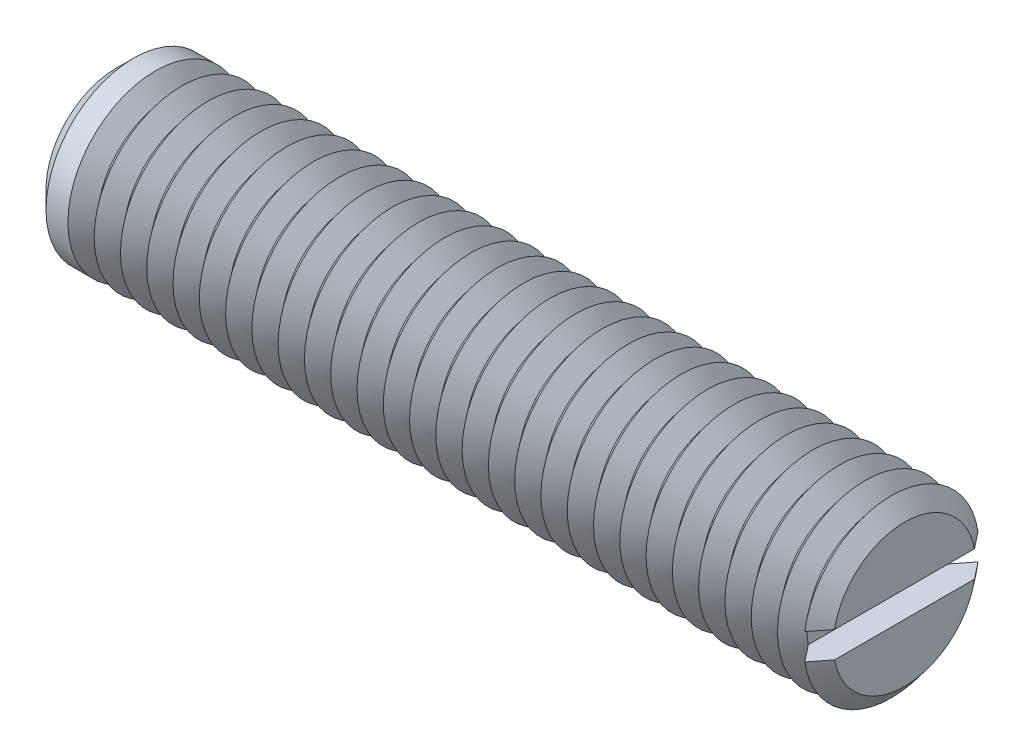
ISO-10303-21;
HEADER;
FILE_DESCRIPTION(('STEP AP214'),'2;1');
FILE_NAME('part.step','',(''),(''),'','','');
FILE_SCHEMA(('AUTOMOTIVE_DESIGN { 1 0 10303 214 1 1 1 1 }'));
ENDSEC;
DATA;
#1=APPLICATION_CONTEXT('core data for automotive mechanical design processes');
#2=APPLICATION_PROTOCOL_DEFINITION('international standard','automotive_design',2000,#1);
#3=PRODUCT_CONTEXT('',#1,'mechanical');
#4=PRODUCT('Part','Part','',(#3));
#5=PRODUCT_RELATED_PRODUCT_CATEGORY('part','',(#4));
#6=PRODUCT_DEFINITION_FORMATION('','',#4);
#7=PRODUCT_DEFINITION_CONTEXT('part definition',#1,'design');
#8=PRODUCT_DEFINITION('design','',#6,#7);
#9=PRODUCT_DEFINITION_SHAPE('','',#8);
#10=(LENGTH_UNIT() NAMED_UNIT(*) SI_UNIT(.MILLI.,.METRE.));
#11=(NAMED_UNIT(*) PLANE_ANGLE_UNIT() SI_UNIT($,.RADIAN.));
#12=(NAMED_UNIT(*) SI_UNIT($,.STERADIAN.) SOLID_ANGLE_UNIT());
#13=UNCERTAINTY_MEASURE_WITH_UNIT(LENGTH_MEASURE(1.E-05),#10,'distance_accuracy_value','');
#14=(GEOMETRIC_REPRESENTATION_CONTEXT(3) GLOBAL_UNCERTAINTY_ASSIGNED_CONTEXT((#13)) GLOBAL_UNIT_ASSIGNED_CONTEXT((#10,
#11,#12)) REPRESENTATION_CONTEXT('',''));
#15=CARTESIAN_POINT('',(0.,0.,0.));
#16=DIRECTION('',(0.,0.,1.));
#17=DIRECTION('',(1.,0.,0.));
#18=AXIS2_PLACEMENT_3D('',#15,#16,#17);
#19=CARTESIAN_POINT('',(21.75,0.,0.));
#20=DIRECTION('',(1.,0.,0.));
#21=DIRECTION('',(0.,0.,-1.));
#22=AXIS2_PLACEMENT_3D('',#19,#20,#21);
#23=CONICAL_SURFACE('',#22,5.,0.895664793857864);
#24=CARTESIAN_POINT('',(21.75,0.,0.));
#25=DIRECTION('',(-1.,0.,0.));
#26=DIRECTION('',(0.,0.,1.));
#27=AXIS2_PLACEMENT_3D('',#24,#25,#26);
#28=CIRCLE('',#27,5.);
#29=CARTESIAN_POINT('',(21.75,-0.75,-4.9434299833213));
#30=VERTEX_POINT('',#29);
#31=CARTESIAN_POINT('',(21.75,-0.75,4.9434299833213));
#32=VERTEX_POINT('',#31);
#33=EDGE_CURVE('E117',#30,#32,#28,.T.);
#34=ORIENTED_EDGE('',*,*,#33,.T.);
#35=CARTESIAN_POINT('',(26.4886555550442,-0.75,-10.8927895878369));
#36=CARTESIAN_POINT('',(26.178663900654,-0.75,-10.5046848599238));
#37=CARTESIAN_POINT('',(25.8687121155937,-0.75,-10.1165482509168));
#38=CARTESIAN_POINT('',(25.2489116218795,-0.75,-9.34012563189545));
#39=CARTESIAN_POINT('',(24.9390629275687,-0.75,-8.95183961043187));
#40=CARTESIAN_POINT('',(24.3189382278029,-0.75,-8.17433811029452));
#41=CARTESIAN_POINT('',(24.0086626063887,-0.75,-7.78512232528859));
#42=CARTESIAN_POINT('',(23.3884400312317,-0.75,-7.00649525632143));
#43=CARTESIAN_POINT('',(23.0784930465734,-0.75,-6.61708399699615));
#44=CARTESIAN_POINT('',(22.6053943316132,-0.75,-6.02191131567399));
#45=CARTESIAN_POINT('',(22.4420627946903,-0.75,-5.81629283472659));
#46=CARTESIAN_POINT('',(22.1155893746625,-0.75,-5.40490151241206));
#47=CARTESIAN_POINT('',(21.9524474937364,-0.75,-5.19912866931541));
#48=CARTESIAN_POINT('',(21.6263799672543,-0.75,-4.78730226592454));
#49=CARTESIAN_POINT('',(21.4634544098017,-0.75,-4.58124863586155));
#50=CARTESIAN_POINT('',(21.138006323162,-0.75,-4.16883695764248));
#51=CARTESIAN_POINT('',(20.9754837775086,-0.75,-3.96247892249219));
#52=CARTESIAN_POINT('',(20.6512888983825,-0.75,-3.54956515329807));
#53=CARTESIAN_POINT('',(20.4896156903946,-0.75,-3.34301010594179));
#54=CARTESIAN_POINT('',(20.1672688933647,-0.75,-2.92906737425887));
#55=CARTESIAN_POINT('',(20.0065954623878,-0.75,-2.72167956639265));
#56=CARTESIAN_POINT('',(19.7671162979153,-0.75,-2.40952296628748));
#57=CARTESIAN_POINT('',(19.687569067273,-0.75,-2.30532351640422));
#58=CARTESIAN_POINT('',(19.5292089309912,-0.75,-2.09636868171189));
#59=CARTESIAN_POINT('',(19.4503960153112,-0.75,-1.99161330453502));
#60=CARTESIAN_POINT('',(19.2939159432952,-0.75,-1.78128982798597));
#61=CARTESIAN_POINT('',(19.2162485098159,-0.75,-1.67572193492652));
#62=CARTESIAN_POINT('',(19.0627483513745,-0.75,-1.46326300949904));
#63=CARTESIAN_POINT('',(18.9869154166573,-0.75,-1.35637213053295));
#64=CARTESIAN_POINT('',(18.8961291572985,-0.75,-1.22407390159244));
#65=CARTESIAN_POINT('',(18.8795740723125,-0.75,-1.19976686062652));
#66=CARTESIAN_POINT('',(18.8466682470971,-0.75,-1.15101442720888));
#67=CARTESIAN_POINT('',(18.8303175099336,-0.75,-1.12656903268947));
#68=CARTESIAN_POINT('',(18.7816161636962,-0.75,-1.05299302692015));
#69=CARTESIAN_POINT('',(18.7496192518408,-0.75,-1.00362669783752));
#70=CARTESIAN_POINT('',(18.6868890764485,-0.75,-0.903957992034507));
#71=CARTESIAN_POINT('',(18.6561584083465,-0.75,-0.853653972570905));
#72=CARTESIAN_POINT('',(18.5966309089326,-0.75,-0.751913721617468));
#73=CARTESIAN_POINT('',(18.5678337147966,-0.75,-0.700477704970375));
#74=CARTESIAN_POINT('',(18.5225435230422,-0.75,-0.613963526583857));
#75=CARTESIAN_POINT('',(18.5052186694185,-0.75,-0.579327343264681));
#76=CARTESIAN_POINT('',(18.4722687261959,-0.75,-0.509265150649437));
#77=CARTESIAN_POINT('',(18.4566439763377,-0.75,-0.473838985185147));
#78=CARTESIAN_POINT('',(18.4132659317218,-0.75,-0.366382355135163));
#79=CARTESIAN_POINT('',(18.3888237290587,-0.75,-0.29284290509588));
#80=CARTESIAN_POINT('',(18.3658405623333,-0.75,-0.189809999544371));
#81=CARTESIAN_POINT('',(18.3606856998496,-0.75,-0.161782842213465));
#82=CARTESIAN_POINT('',(18.3527704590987,-0.75,-0.105398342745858));
#83=CARTESIAN_POINT('',(18.3500088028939,-0.75,-0.0770411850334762));
#84=CARTESIAN_POINT('',(18.3470684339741,-0.75,-0.020254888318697));
#85=CARTESIAN_POINT('',(18.3468839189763,-0.75,0.00817394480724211));
#86=CARTESIAN_POINT('',(18.3490950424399,-0.75,0.0649322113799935));
#87=CARTESIAN_POINT('',(18.351491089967,-0.75,0.09326162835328));
#88=CARTESIAN_POINT('',(18.3596937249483,-0.75,0.157351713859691));
#89=CARTESIAN_POINT('',(18.3662565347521,-0.75,0.19301541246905));
#90=CARTESIAN_POINT('',(18.3827020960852,-0.75,0.263573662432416));
#91=CARTESIAN_POINT('',(18.3925874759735,-0.75,0.298467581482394));
#92=CARTESIAN_POINT('',(18.4150598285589,-0.75,0.3676520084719));
#93=CARTESIAN_POINT('',(18.4276667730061,-0.75,0.401935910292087));
#94=CARTESIAN_POINT('',(18.4549130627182,-0.75,0.469664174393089));
#95=CARTESIAN_POINT('',(18.4695519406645,-0.75,0.503108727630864));
#96=CARTESIAN_POINT('',(18.5166350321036,-0.75,0.60425999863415));
#97=CARTESIAN_POINT('',(18.551542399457,-0.75,0.670810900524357));
#98=CARTESIAN_POINT('',(18.6250588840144,-0.75,0.801849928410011));
#99=CARTESIAN_POINT('',(18.6636717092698,-0.75,0.866335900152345));
#100=CARTESIAN_POINT('',(18.7432739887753,-0.75,0.994050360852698));
#101=CARTESIAN_POINT('',(18.7842693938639,-0.75,1.05727512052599));
#102=CARTESIAN_POINT('',(18.8677403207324,-0.75,1.18274150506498));
#103=CARTESIAN_POINT('',(18.9102160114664,-0.75,1.24498301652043));
#104=CARTESIAN_POINT('',(18.9963066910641,-0.75,1.36895722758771));
#105=CARTESIAN_POINT('',(19.0399248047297,-0.75,1.43068775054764));
#106=CARTESIAN_POINT('',(19.1278819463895,-0.75,1.55364126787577));
#107=CARTESIAN_POINT('',(19.172221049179,-0.75,1.61486420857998));
#108=CARTESIAN_POINT('',(19.2613408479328,-0.75,1.73681254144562));
#109=CARTESIAN_POINT('',(19.3061205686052,-0.75,1.79753864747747));
#110=CARTESIAN_POINT('',(19.3960732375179,-0.75,1.91869503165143));
#111=CARTESIAN_POINT('',(19.4412461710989,-0.75,1.97912532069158));
#112=CARTESIAN_POINT('',(19.576109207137,-0.75,2.1586036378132));
#113=CARTESIAN_POINT('',(19.6662359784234,-0.75,2.27732336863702));
#114=CARTESIAN_POINT('',(19.8472315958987,-0.75,2.51419617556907));
#115=CARTESIAN_POINT('',(19.9381004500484,-0.75,2.63234924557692));
#116=CARTESIAN_POINT('',(20.2114512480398,-0.75,2.98624879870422));
#117=CARTESIAN_POINT('',(20.3946699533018,-0.75,3.22142577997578));
#118=CARTESIAN_POINT('',(20.762238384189,-0.75,3.69117947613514));
#119=CARTESIAN_POINT('',(20.9465888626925,-0.75,3.92575559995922));
#120=CARTESIAN_POINT('',(21.31587911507,-0.75,4.39443534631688));
#121=CARTESIAN_POINT('',(21.500818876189,-0.75,4.62853897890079));
#122=CARTESIAN_POINT('',(21.8703317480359,-0.75,5.09551589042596));
#123=CARTESIAN_POINT('',(22.0549033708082,-0.75,5.32839034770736));
#124=CARTESIAN_POINT('',(22.4242990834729,-0.75,5.7939410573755));
#125=CARTESIAN_POINT('',(22.6091231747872,-0.75,6.02661730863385));
#126=CARTESIAN_POINT('',(23.1637745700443,-0.75,6.7243369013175));
#127=CARTESIAN_POINT('',(23.5338620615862,-0.75,7.18917337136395));
#128=CARTESIAN_POINT('',(24.1190458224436,-0.75,7.92356230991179));
#129=CARTESIAN_POINT('',(24.3340169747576,-0.75,8.19321453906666));
#130=CARTESIAN_POINT('',(24.7640698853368,-0.75,8.73245662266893));
#131=CARTESIAN_POINT('',(24.9791516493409,-0.75,9.00204647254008));
#132=CARTESIAN_POINT('',(25.4099436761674,-0.75,9.54186292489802));
#133=CARTESIAN_POINT('',(25.6256541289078,-0.75,9.81208937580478));
#134=CARTESIAN_POINT('',(26.0571210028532,-0.75,10.3524795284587));
#135=CARTESIAN_POINT('',(26.2728774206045,-0.75,10.6226432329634));
#136=CARTESIAN_POINT('',(26.4886555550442,-0.75,10.8927895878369));
#137=B_SPLINE_CURVE_WITH_KNOTS('',3,(#35,#36,#37,#38,#39,#40,#41,#42,#43,#44,#45,#46,#47,#48,
#49,#50,#51,#52,#53,#54,#55,#56,#57,#58,#59,#60,#61,#62,#63,#64,#65,#66,#67,#68,#69,#70,#71,#72,
#73,#74,#75,#76,#77,#78,#79,#80,#81,#82,#83,#84,#85,#86,#87,#88,#89,#90,#91,#92,#93,#94,#95,#96,
#97,#98,#99,#100,#101,#102,#103,#104,#105,#106,#107,#108,#109,#110,#111,#112,#113,#114,#115,
#116,#117,#118,#119,#120,#121,#122,#123,#124,#125,#126,#127,#128,#129,#130,#131,#132,#133,#134,
#135,#136),.UNSPECIFIED.,.F.,.F.,(4,2,2,2,2,2,2,2,2,2,2,2,2,2,2,2,2,2,2,2,2,2,2,2,2,2,2,2,2,2,2,
2,2,2,2,2,2,2,2,2,2,2,2,2,2,2,2,2,2,2,4),(0.,1.49012787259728,2.98041311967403,4.47367759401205,
5.96678625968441,6.75457128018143,7.54236526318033,8.33041673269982,9.11843545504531,
9.90534542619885,10.6923767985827,11.0856530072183,11.4789238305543,11.8720978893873,
12.265226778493,12.3534535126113,12.441681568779,12.6181526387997,12.7949690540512,
12.9717521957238,13.0878863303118,13.2040436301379,13.43522465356,13.5206311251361,
13.6059919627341,13.6911605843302,13.7763427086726,13.8849305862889,13.9936045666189,
14.1031049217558,14.2125801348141,14.4377857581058,14.6632191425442,14.8892420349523,
15.1152908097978,15.3420406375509,15.5688141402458,15.795165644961,16.0215087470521,
16.4686664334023,16.91582892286,17.8101909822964,18.7052318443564,19.6002534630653,
20.4916985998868,21.3831487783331,23.1656575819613,24.2002223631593,25.2348477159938,
26.2721422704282,27.3093757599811),.UNSPECIFIED.);
#138=CARTESIAN_POINT('',(21.,-0.75,3.99343248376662));
#139=VERTEX_POINT('',#138);
#140=EDGE_CURVE('E109',#139,#32,#137,.T.);
#141=ORIENTED_EDGE('',*,*,#140,.F.);
#142=CARTESIAN_POINT('',(21.,0.,0.));
#143=DIRECTION('',(-1.,0.,0.));
#144=DIRECTION('',(0.,0.,1.));
#145=AXIS2_PLACEMENT_3D('',#142,#143,#144);
#146=CIRCLE('',#145,4.06325030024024);
#147=CARTESIAN_POINT('',(21.,-0.75,-3.99343248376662));
#148=VERTEX_POINT('',#147);
#149=EDGE_CURVE('E448',#148,#139,#146,.T.);
#150=ORIENTED_EDGE('',*,*,#149,.F.);
#151=EDGE_CURVE('E58',#30,#148,#137,.T.);
#152=ORIENTED_EDGE('',*,*,#151,.F.);
#153=EDGE_LOOP('',(#34,#141,#150,#152));
#154=FACE_BOUND('',#153,.T.);
#155=ADVANCED_FACE('F37',(#154),#23,.T.);
#156=CARTESIAN_POINT('',(21.75,0.75,4.9434299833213));
#157=VERTEX_POINT('',#156);
#158=CARTESIAN_POINT('',(21.75,0.75,-4.9434299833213));
#159=VERTEX_POINT('',#158);
#160=EDGE_CURVE('E100',#157,#159,#28,.T.);
#161=ORIENTED_EDGE('',*,*,#160,.T.);
#162=CARTESIAN_POINT('',(26.4886555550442,0.75,10.8927895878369));
#163=CARTESIAN_POINT('',(26.178663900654,0.75,10.5046848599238));
#164=CARTESIAN_POINT('',(25.8687121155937,0.75,10.1165482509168));
#165=CARTESIAN_POINT('',(25.2489116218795,0.75,9.34012563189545));
#166=CARTESIAN_POINT('',(24.9390629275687,0.75,8.95183961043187));
#167=CARTESIAN_POINT('',(24.3189382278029,0.75,8.17433811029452));
#168=CARTESIAN_POINT('',(24.0086626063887,0.75,7.78512232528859));
#169=CARTESIAN_POINT('',(23.3884400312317,0.75,7.00649525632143));
#170=CARTESIAN_POINT('',(23.0784930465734,0.75,6.61708399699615));
#171=CARTESIAN_POINT('',(22.6053943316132,0.75,6.02191131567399));
#172=CARTESIAN_POINT('',(22.4420627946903,0.75,5.81629283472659));
#173=CARTESIAN_POINT('',(22.1155893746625,0.75,5.40490151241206));
#174=CARTESIAN_POINT('',(21.9524474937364,0.75,5.19912866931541));
#175=CARTESIAN_POINT('',(21.6263799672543,0.75,4.78730226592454));
#176=CARTESIAN_POINT('',(21.4634544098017,0.75,4.58124863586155));
#177=CARTESIAN_POINT('',(21.138006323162,0.75,4.16883695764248));
#178=CARTESIAN_POINT('',(20.9754837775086,0.75,3.96247892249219));
#179=CARTESIAN_POINT('',(20.6512888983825,0.75,3.54956515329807));
#180=CARTESIAN_POINT('',(20.4896156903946,0.75,3.34301010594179));
#181=CARTESIAN_POINT('',(20.1672688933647,0.75,2.92906737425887));
#182=CARTESIAN_POINT('',(20.0065954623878,0.75,2.72167956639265));
#183=CARTESIAN_POINT('',(19.7671162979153,0.75,2.40952296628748));
#184=CARTESIAN_POINT('',(19.687569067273,0.75,2.30532351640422));
#185=CARTESIAN_POINT('',(19.5292089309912,0.75,2.09636868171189));
#186=CARTESIAN_POINT('',(19.4503960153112,0.75,1.99161330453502));
#187=CARTESIAN_POINT('',(19.2939159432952,0.75,1.78128982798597));
#188=CARTESIAN_POINT('',(19.2162485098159,0.75,1.67572193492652));
#189=CARTESIAN_POINT('',(19.0627483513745,0.75,1.46326300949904));
#190=CARTESIAN_POINT('',(18.9869154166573,0.75,1.35637213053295));
#191=CARTESIAN_POINT('',(18.8961291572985,0.75,1.22407390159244));
#192=CARTESIAN_POINT('',(18.8795740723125,0.75,1.19976686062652));
#193=CARTESIAN_POINT('',(18.8466682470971,0.75,1.15101442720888));
#194=CARTESIAN_POINT('',(18.8303175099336,0.75,1.12656903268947));
#195=CARTESIAN_POINT('',(18.7816161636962,0.75,1.05299302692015));
#196=CARTESIAN_POINT('',(18.7496192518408,0.75,1.00362669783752));
#197=CARTESIAN_POINT('',(18.6868890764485,0.75,0.903957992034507));
#198=CARTESIAN_POINT('',(18.6561584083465,0.75,0.853653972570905));
#199=CARTESIAN_POINT('',(18.5966309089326,0.75,0.751913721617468));
#200=CARTESIAN_POINT('',(18.5678337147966,0.75,0.700477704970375));
#201=CARTESIAN_POINT('',(18.5225435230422,0.75,0.613963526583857));
#202=CARTESIAN_POINT('',(18.5052186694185,0.75,0.579327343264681));
#203=CARTESIAN_POINT('',(18.4722687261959,0.75,0.509265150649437));
#204=CARTESIAN_POINT('',(18.4566439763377,0.75,0.473838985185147));
#205=CARTESIAN_POINT('',(18.4132659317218,0.75,0.366382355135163));
#206=CARTESIAN_POINT('',(18.3888237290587,0.75,0.29284290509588));
#207=CARTESIAN_POINT('',(18.3658405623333,0.75,0.189809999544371));
#208=CARTESIAN_POINT('',(18.3606856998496,0.75,0.161782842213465));
#209=CARTESIAN_POINT('',(18.3527704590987,0.75,0.105398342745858));
#210=CARTESIAN_POINT('',(18.3500088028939,0.75,0.0770411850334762));
#211=CARTESIAN_POINT('',(18.3470684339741,0.75,0.020254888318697));
#212=CARTESIAN_POINT('',(18.3468839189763,0.75,-0.00817394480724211));
#213=CARTESIAN_POINT('',(18.3490950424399,0.75,-0.0649322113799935));
#214=CARTESIAN_POINT('',(18.351491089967,0.75,-0.09326162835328));
#215=CARTESIAN_POINT('',(18.3596937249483,0.75,-0.157351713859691));
#216=CARTESIAN_POINT('',(18.3662565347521,0.75,-0.19301541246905));
#217=CARTESIAN_POINT('',(18.3827020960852,0.75,-0.263573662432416));
#218=CARTESIAN_POINT('',(18.3925874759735,0.75,-0.298467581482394));
#219=CARTESIAN_POINT('',(18.4150598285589,0.75,-0.3676520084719));
#220=CARTESIAN_POINT('',(18.4276667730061,0.75,-0.401935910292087));
#221=CARTESIAN_POINT('',(18.4549130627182,0.75,-0.469664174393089));
#222=CARTESIAN_POINT('',(18.4695519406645,0.75,-0.503108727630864));
#223=CARTESIAN_POINT('',(18.5166350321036,0.75,-0.60425999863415));
#224=CARTESIAN_POINT('',(18.551542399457,0.75,-0.670810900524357));
#225=CARTESIAN_POINT('',(18.6250588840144,0.75,-0.801849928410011));
#226=CARTESIAN_POINT('',(18.6636717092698,0.75,-0.866335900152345));
#227=CARTESIAN_POINT('',(18.7432739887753,0.75,-0.994050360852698));
#228=CARTESIAN_POINT('',(18.7842693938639,0.75,-1.05727512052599));
#229=CARTESIAN_POINT('',(18.8677403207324,0.75,-1.18274150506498));
#230=CARTESIAN_POINT('',(18.9102160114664,0.75,-1.24498301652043));
#231=CARTESIAN_POINT('',(18.9963066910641,0.75,-1.36895722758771));
#232=CARTESIAN_POINT('',(19.0399248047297,0.75,-1.43068775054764));
#233=CARTESIAN_POINT('',(19.1278819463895,0.75,-1.55364126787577));
#234=CARTESIAN_POINT('',(19.172221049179,0.75,-1.61486420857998));
#235=CARTESIAN_POINT('',(19.2613408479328,0.75,-1.73681254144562));
#236=CARTESIAN_POINT('',(19.3061205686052,0.75,-1.79753864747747));
#237=CARTESIAN_POINT('',(19.3960732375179,0.75,-1.91869503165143));
#238=CARTESIAN_POINT('',(19.4412461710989,0.75,-1.97912532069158));
#239=CARTESIAN_POINT('',(19.576109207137,0.75,-2.1586036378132));
#240=CARTESIAN_POINT('',(19.6662359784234,0.75,-2.27732336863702));
#241=CARTESIAN_POINT('',(19.8472315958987,0.75,-2.51419617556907));
#242=CARTESIAN_POINT('',(19.9381004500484,0.75,-2.63234924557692));
#243=CARTESIAN_POINT('',(20.2114512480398,0.75,-2.98624879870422));
#244=CARTESIAN_POINT('',(20.3946699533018,0.75,-3.22142577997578));
#245=CARTESIAN_POINT('',(20.762238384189,0.75,-3.69117947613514));
#246=CARTESIAN_POINT('',(20.9465888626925,0.75,-3.92575559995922));
#247=CARTESIAN_POINT('',(21.31587911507,0.75,-4.39443534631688));
#248=CARTESIAN_POINT('',(21.500818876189,0.75,-4.62853897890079));
#249=CARTESIAN_POINT('',(21.8703317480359,0.75,-5.09551589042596));
#250=CARTESIAN_POINT('',(22.0549033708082,0.75,-5.32839034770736));
#251=CARTESIAN_POINT('',(22.4242990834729,0.75,-5.7939410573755));
#252=CARTESIAN_POINT('',(22.6091231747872,0.75,-6.02661730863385));
#253=CARTESIAN_POINT('',(23.1637745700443,0.75,-6.7243369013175));
#254=CARTESIAN_POINT('',(23.5338620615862,0.75,-7.18917337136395));
#255=CARTESIAN_POINT('',(24.1190458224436,0.75,-7.92356230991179));
#256=CARTESIAN_POINT('',(24.3340169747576,0.75,-8.19321453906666));
#257=CARTESIAN_POINT('',(24.7640698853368,0.75,-8.73245662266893));
#258=CARTESIAN_POINT('',(24.9791516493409,0.75,-9.00204647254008));
#259=CARTESIAN_POINT('',(25.4099436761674,0.75,-9.54186292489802));
#260=CARTESIAN_POINT('',(25.6256541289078,0.75,-9.81208937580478));
#261=CARTESIAN_POINT('',(26.0571210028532,0.75,-10.3524795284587));
#262=CARTESIAN_POINT('',(26.2728774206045,0.75,-10.6226432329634));
#263=CARTESIAN_POINT('',(26.4886555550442,0.75,-10.8927895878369));
#264=B_SPLINE_CURVE_WITH_KNOTS('',3,(#162,#163,#164,#165,#166,#167,#168,#169,#170,#171,#172,
#173,#174,#175,#176,#177,#178,#179,#180,#181,#182,#183,#184,#185,#186,#187,#188,#189,#190,#191,
#192,#193,#194,#195,#196,#197,#198,#199,#200,#201,#202,#203,#204,#205,#206,#207,#208,#209,#210,
#211,#212,#213,#214,#215,#216,#217,#218,#219,#220,#221,#222,#223,#224,#225,#226,#227,#228,#229,
#230,#231,#232,#233,#234,#235,#236,#237,#238,#239,#240,#241,#242,#243,#244,#245,#246,#247,#248,
#249,#250,#251,#252,#253,#254,#255,#256,#257,#258,#259,#260,#261,#262,#263),.UNSPECIFIED.,.F.,
.F.,(4,2,2,2,2,2,2,2,2,2,2,2,2,2,2,2,2,2,2,2,2,2,2,2,2,2,2,2,2,2,2,2,2,2,2,2,2,2,2,2,2,2,2,2,2,
2,2,2,2,2,4),(0.,1.49012787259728,2.98041311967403,4.47367759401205,5.96678625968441,
6.75457128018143,7.54236526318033,8.33041673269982,9.11843545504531,9.90534542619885,
10.6923767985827,11.0856530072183,11.4789238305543,11.8720978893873,12.265226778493,
12.3534535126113,12.441681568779,12.6181526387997,12.7949690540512,12.9717521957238,
13.0878863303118,13.2040436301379,13.43522465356,13.5206311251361,13.6059919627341,
13.6911605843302,13.7763427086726,13.8849305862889,13.9936045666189,14.1031049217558,
14.2125801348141,14.4377857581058,14.6632191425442,14.8892420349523,15.1152908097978,
15.3420406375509,15.5688141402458,15.795165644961,16.0215087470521,16.4686664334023,
16.91582892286,17.8101909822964,18.7052318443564,19.6002534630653,20.4916985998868,
21.3831487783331,23.1656575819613,24.2002223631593,25.2348477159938,26.2721422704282,
27.3093757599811),.UNSPECIFIED.);
#265=CARTESIAN_POINT('',(21.,0.75,-3.99343248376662));
#266=VERTEX_POINT('',#265);
#267=EDGE_CURVE('E110',#266,#159,#264,.T.);
#268=ORIENTED_EDGE('',*,*,#267,.F.);
#269=CARTESIAN_POINT('',(21.,0.75,3.99343248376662));
#270=VERTEX_POINT('',#269);
#271=EDGE_CURVE('E103',#270,#266,#146,.T.);
#272=ORIENTED_EDGE('',*,*,#271,.F.);
#273=EDGE_CURVE('E97',#157,#270,#264,.T.);
#274=ORIENTED_EDGE('',*,*,#273,.F.);
#275=EDGE_LOOP('',(#161,#268,#272,#274));
#276=FACE_BOUND('',#275,.T.);
#277=ADVANCED_FACE('F99',(#276),#23,.T.);
#278=CARTESIAN_POINT('',(21.,0.,0.));
#279=DIRECTION('',(-1.,0.,0.));
#280=DIRECTION('',(0.,0.,1.));
#281=AXIS2_PLACEMENT_3D('',#278,#279,#280);
#282=CONICAL_SURFACE('',#281,4.06325030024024,0.895664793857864);
#283=CARTESIAN_POINT('',(20.25,0.,0.));
#284=DIRECTION('',(-1.,0.,0.));
#285=DIRECTION('',(0.,0.,1.));
#286=AXIS2_PLACEMENT_3D('',#283,#284,#285);
#287=CIRCLE('',#286,5.);
#288=CARTESIAN_POINT('',(20.25,0.,5.));
#289=VERTEX_POINT('',#288);
#290=EDGE_CURVE('E435',#289,#289,#287,.T.);
#291=ORIENTED_EDGE('',*,*,#290,.F.);
#292=EDGE_LOOP('',(#291));
#293=FACE_BOUND('',#292,.T.);
#294=ORIENTED_EDGE('',*,*,#271,.T.);
#295=EDGE_CURVE('E442',#266,#148,#146,.T.);
#296=ORIENTED_EDGE('',*,*,#295,.T.);
#297=ORIENTED_EDGE('',*,*,#149,.T.);
#298=EDGE_CURVE('E441',#139,#270,#146,.T.);
#299=ORIENTED_EDGE('',*,*,#298,.T.);
#300=EDGE_LOOP('',(#294,#296,#297,#299));
#301=FACE_BOUND('',#300,.T.);
#302=ADVANCED_FACE('F167',(#293,#301),#282,.T.);
#303=CARTESIAN_POINT('',(22.5,0.,0.));
#304=DIRECTION('',(1.,0.,0.));
#305=DIRECTION('',(0.,0.,-1.));
#306=AXIS2_PLACEMENT_3D('',#303,#304,#305);
#307=PLANE('',#306);
#308=CARTESIAN_POINT('',(22.5,0.,0.));
#309=DIRECTION('',(-1.,0.,0.));
#310=DIRECTION('',(0.,0.,1.));
#311=AXIS2_PLACEMENT_3D('',#308,#309,#310);
#312=CIRCLE('',#311,4.06325030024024);
#313=CARTESIAN_POINT('',(22.5,0.75,3.99343248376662));
#314=VERTEX_POINT('',#313);
#315=CARTESIAN_POINT('',(22.5,0.75,-3.99343248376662));
#316=VERTEX_POINT('',#315);
#317=EDGE_CURVE('E159',#314,#316,#312,.T.);
#318=ORIENTED_EDGE('',*,*,#317,.F.);
#319=DIRECTION('',(0.,0.,1.));
#320=VECTOR('',#319,1.);
#321=CARTESIAN_POINT('',(22.5,0.75,0.));
#322=LINE('',#321,#320);
#323=EDGE_CURVE('E122',#316,#314,#322,.T.);
#324=ORIENTED_EDGE('',*,*,#323,.F.);
#325=EDGE_LOOP('',(#318,#324));
#326=FACE_BOUND('',#325,.T.);
#327=ADVANCED_FACE('F171',(#326),#307,.T.);
#328=CARTESIAN_POINT('',(22.5,-0.75,-3.99343248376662));
#329=VERTEX_POINT('',#328);
#330=CARTESIAN_POINT('',(22.5,-0.75,3.99343248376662));
#331=VERTEX_POINT('',#330);
#332=EDGE_CURVE('E66',#329,#331,#312,.T.);
#333=ORIENTED_EDGE('',*,*,#332,.F.);
#334=DIRECTION('',(0.,0.,-1.));
#335=VECTOR('',#334,1.);
#336=CARTESIAN_POINT('',(22.5,-0.75,0.));
#337=LINE('',#336,#335);
#338=EDGE_CURVE('E135',#331,#329,#337,.T.);
#339=ORIENTED_EDGE('',*,*,#338,.F.);
#340=EDGE_LOOP('',(#333,#339));
#341=FACE_BOUND('',#340,.T.);
#342=ADVANCED_FACE('F202',(#341),#307,.T.);
#343=CARTESIAN_POINT('',(22.5,0.,0.));
#344=DIRECTION('',(-1.,0.,0.));
#345=DIRECTION('',(0.,0.,1.));
#346=AXIS2_PLACEMENT_3D('',#343,#344,#345);
#347=CONICAL_SURFACE('',#346,4.06325030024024,0.895664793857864);
#348=ORIENTED_EDGE('',*,*,#160,.F.);
#349=CARTESIAN_POINT('',(17.0113444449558,0.75,-10.8927895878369));
#350=CARTESIAN_POINT('',(17.321336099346,0.75,-10.5046848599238));
#351=CARTESIAN_POINT('',(17.6312878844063,0.75,-10.1165482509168));
#352=CARTESIAN_POINT('',(18.2510883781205,0.75,-9.34012563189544));
#353=CARTESIAN_POINT('',(18.5609370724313,0.75,-8.95183961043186));
#354=CARTESIAN_POINT('',(19.1810617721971,0.75,-8.17433811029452));
#355=CARTESIAN_POINT('',(19.4913373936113,0.75,-7.78512232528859));
#356=CARTESIAN_POINT('',(20.1115599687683,0.75,-7.00649525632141));
#357=CARTESIAN_POINT('',(20.4215069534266,0.75,-6.61708399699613));
#358=CARTESIAN_POINT('',(20.8946056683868,0.75,-6.02191131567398));
#359=CARTESIAN_POINT('',(21.0579372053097,0.75,-5.81629283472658));
#360=CARTESIAN_POINT('',(21.3844106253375,0.75,-5.40490151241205));
#361=CARTESIAN_POINT('',(21.5475525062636,0.75,-5.1991286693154));
#362=CARTESIAN_POINT('',(21.8736200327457,0.75,-4.78730226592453));
#363=CARTESIAN_POINT('',(22.0365455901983,0.75,-4.58124863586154));
#364=CARTESIAN_POINT('',(22.361993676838,0.75,-4.16883695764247));
#365=CARTESIAN_POINT('',(22.5245162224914,0.75,-3.96247892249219));
#366=CARTESIAN_POINT('',(22.8487111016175,0.75,-3.54956515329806));
#367=CARTESIAN_POINT('',(23.0103843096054,0.75,-3.34301010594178));
#368=CARTESIAN_POINT('',(23.3327311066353,0.75,-2.92906737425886));
#369=CARTESIAN_POINT('',(23.4934045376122,0.75,-2.72167956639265));
#370=CARTESIAN_POINT('',(23.7328837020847,0.75,-2.40952296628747));
#371=CARTESIAN_POINT('',(23.812430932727,0.75,-2.30532351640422));
#372=CARTESIAN_POINT('',(23.9707910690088,0.75,-2.09636868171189));
#373=CARTESIAN_POINT('',(24.0496039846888,0.75,-1.99161330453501));
#374=CARTESIAN_POINT('',(24.2060840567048,0.75,-1.78128982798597));
#375=CARTESIAN_POINT('',(24.2837514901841,0.75,-1.67572193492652));
#376=CARTESIAN_POINT('',(24.4372516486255,0.75,-1.46326300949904));
#377=CARTESIAN_POINT('',(24.5130845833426,0.75,-1.35637213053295));
#378=CARTESIAN_POINT('',(24.6038708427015,0.75,-1.22407390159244));
#379=CARTESIAN_POINT('',(24.6204259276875,0.75,-1.19976686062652));
#380=CARTESIAN_POINT('',(24.6533317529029,0.75,-1.15101442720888));
#381=CARTESIAN_POINT('',(24.6696824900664,0.75,-1.12656903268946));
#382=CARTESIAN_POINT('',(24.7183838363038,0.75,-1.05299302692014));
#383=CARTESIAN_POINT('',(24.7503807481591,0.75,-1.00362669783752));
#384=CARTESIAN_POINT('',(24.8131109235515,0.75,-0.903957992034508));
#385=CARTESIAN_POINT('',(24.8438415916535,0.75,-0.853653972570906));
#386=CARTESIAN_POINT('',(24.9033690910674,0.75,-0.751913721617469));
#387=CARTESIAN_POINT('',(24.9321662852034,0.75,-0.700477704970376));
#388=CARTESIAN_POINT('',(24.9774564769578,0.75,-0.613963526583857));
#389=CARTESIAN_POINT('',(24.9947813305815,0.75,-0.579327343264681));
#390=CARTESIAN_POINT('',(25.0277312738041,0.75,-0.509265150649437));
#391=CARTESIAN_POINT('',(25.0433560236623,0.75,-0.473838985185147));
#392=CARTESIAN_POINT('',(25.0867340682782,0.75,-0.366382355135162));
#393=CARTESIAN_POINT('',(25.1111762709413,0.75,-0.292842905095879));
#394=CARTESIAN_POINT('',(25.1341594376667,0.75,-0.189809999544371));
#395=CARTESIAN_POINT('',(25.1393143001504,0.75,-0.161782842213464));
#396=CARTESIAN_POINT('',(25.1472295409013,0.75,-0.105398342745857));
#397=CARTESIAN_POINT('',(25.1499911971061,0.75,-0.0770411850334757));
#398=CARTESIAN_POINT('',(25.1529315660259,0.75,-0.0202548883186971));
#399=CARTESIAN_POINT('',(25.1531160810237,0.75,0.00817394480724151));
#400=CARTESIAN_POINT('',(25.1509049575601,0.75,0.0649322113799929));
#401=CARTESIAN_POINT('',(25.148508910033,0.75,0.09326162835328));
#402=CARTESIAN_POINT('',(25.1403062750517,0.75,0.157351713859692));
#403=CARTESIAN_POINT('',(25.1337434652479,0.75,0.19301541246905));
#404=CARTESIAN_POINT('',(25.1172979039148,0.75,0.263573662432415));
#405=CARTESIAN_POINT('',(25.1074125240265,0.75,0.298467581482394));
#406=CARTESIAN_POINT('',(25.0849401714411,0.75,0.3676520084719));
#407=CARTESIAN_POINT('',(25.0723332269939,0.75,0.401935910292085));
#408=CARTESIAN_POINT('',(25.0450869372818,0.75,0.469664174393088));
#409=CARTESIAN_POINT('',(25.0304480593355,0.75,0.503108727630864));
#410=CARTESIAN_POINT('',(24.9833649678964,0.75,0.604259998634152));
#411=CARTESIAN_POINT('',(24.948457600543,0.75,0.670810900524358));
#412=CARTESIAN_POINT('',(24.8749411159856,0.75,0.801849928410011));
#413=CARTESIAN_POINT('',(24.8363282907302,0.75,0.866335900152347));
#414=CARTESIAN_POINT('',(24.7567260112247,0.75,0.9940503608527));
#415=CARTESIAN_POINT('',(24.715730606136,0.75,1.05727512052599));
#416=CARTESIAN_POINT('',(24.6322596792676,0.75,1.18274150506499));
#417=CARTESIAN_POINT('',(24.5897839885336,0.75,1.24498301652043));
#418=CARTESIAN_POINT('',(24.5036933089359,0.75,1.36895722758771));
#419=CARTESIAN_POINT('',(24.4600751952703,0.75,1.43068775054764));
#420=CARTESIAN_POINT('',(24.3721180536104,0.75,1.55364126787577));
#421=CARTESIAN_POINT('',(24.327778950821,0.75,1.61486420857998));
#422=CARTESIAN_POINT('',(24.2386591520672,0.75,1.73681254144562));
#423=CARTESIAN_POINT('',(24.1938794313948,0.75,1.79753864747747));
#424=CARTESIAN_POINT('',(24.1039267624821,0.75,1.91869503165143));
#425=CARTESIAN_POINT('',(24.0587538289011,0.75,1.97912532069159));
#426=CARTESIAN_POINT('',(23.923890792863,0.75,2.15860363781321));
#427=CARTESIAN_POINT('',(23.8337640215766,0.75,2.27732336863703));
#428=CARTESIAN_POINT('',(23.6527684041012,0.75,2.51419617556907));
#429=CARTESIAN_POINT('',(23.5618995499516,0.75,2.63234924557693));
#430=CARTESIAN_POINT('',(23.2885487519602,0.75,2.98624879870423));
#431=CARTESIAN_POINT('',(23.1053300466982,0.75,3.2214257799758));
#432=CARTESIAN_POINT('',(22.737761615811,0.75,3.69117947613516));
#433=CARTESIAN_POINT('',(22.5534111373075,0.75,3.92575559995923));
#434=CARTESIAN_POINT('',(22.18412088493,0.75,4.39443534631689));
#435=CARTESIAN_POINT('',(21.999181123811,0.75,4.62853897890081));
#436=CARTESIAN_POINT('',(21.629668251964,0.75,5.09551589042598));
#437=CARTESIAN_POINT('',(21.4450966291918,0.75,5.32839034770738));
#438=CARTESIAN_POINT('',(21.0757009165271,0.75,5.79394105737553));
#439=CARTESIAN_POINT('',(20.8908768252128,0.75,6.02661730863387));
#440=CARTESIAN_POINT('',(20.3362254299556,0.75,6.72433690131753));
#441=CARTESIAN_POINT('',(19.9661379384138,0.75,7.18917337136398));
#442=CARTESIAN_POINT('',(19.3809541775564,0.75,7.92356230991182));
#443=CARTESIAN_POINT('',(19.1659830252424,0.75,8.19321453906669));
#444=CARTESIAN_POINT('',(18.7359301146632,0.75,8.73245662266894));
#445=CARTESIAN_POINT('',(18.520848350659,0.75,9.00204647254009));
#446=CARTESIAN_POINT('',(18.0900563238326,0.75,9.54186292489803));
#447=CARTESIAN_POINT('',(17.8743458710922,0.75,9.81208937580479));
#448=CARTESIAN_POINT('',(17.4428789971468,0.75,10.3524795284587));
#449=CARTESIAN_POINT('',(17.2271225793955,0.75,10.6226432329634));
#450=CARTESIAN_POINT('',(17.0113444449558,0.75,10.8927895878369));
#451=B_SPLINE_CURVE_WITH_KNOTS('',3,(#349,#350,#351,#352,#353,#354,#355,#356,#357,#358,#359,
#360,#361,#362,#363,#364,#365,#366,#367,#368,#369,#370,#371,#372,#373,#374,#375,#376,#377,#378,
#379,#380,#381,#382,#383,#384,#385,#386,#387,#388,#389,#390,#391,#392,#393,#394,#395,#396,#397,
#398,#399,#400,#401,#402,#403,#404,#405,#406,#407,#408,#409,#410,#411,#412,#413,#414,#415,#416,
#417,#418,#419,#420,#421,#422,#423,#424,#425,#426,#427,#428,#429,#430,#431,#432,#433,#434,#435,
#436,#437,#438,#439,#440,#441,#442,#443,#444,#445,#446,#447,#448,#449,#450),.UNSPECIFIED.,.F.,
.F.,(4,2,2,2,2,2,2,2,2,2,2,2,2,2,2,2,2,2,2,2,2,2,2,2,2,2,2,2,2,2,2,2,2,2,2,2,2,2,2,2,2,2,2,2,2,
2,2,2,2,2,4),(0.,1.49012787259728,2.98041311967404,4.47367759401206,5.96678625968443,
6.75457128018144,7.54236526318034,8.33041673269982,9.11843545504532,9.90534542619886,
10.6923767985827,11.0856530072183,11.4789238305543,11.8720978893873,12.265226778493,
12.3534535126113,12.441681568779,12.6181526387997,12.7949690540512,12.9717521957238,
13.0878863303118,13.2040436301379,13.43522465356,13.5206311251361,13.6059919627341,
13.6911605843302,13.7763427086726,13.8849305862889,13.9936045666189,14.1031049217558,
14.2125801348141,14.4377857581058,14.6632191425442,14.8892420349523,15.1152908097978,
15.3420406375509,15.5688141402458,15.795165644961,16.0215087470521,16.4686664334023,
16.91582892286,17.8101909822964,18.7052318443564,19.6002534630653,20.4916985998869,
21.3831487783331,23.1656575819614,24.2002223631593,25.2348477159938,26.2721422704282,
27.3093757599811),.UNSPECIFIED.);
#452=EDGE_CURVE('E41',#314,#157,#451,.T.);
#453=ORIENTED_EDGE('',*,*,#452,.F.);
#454=ORIENTED_EDGE('',*,*,#317,.T.);
#455=EDGE_CURVE('E11',#159,#316,#451,.T.);
#456=ORIENTED_EDGE('',*,*,#455,.F.);
#457=EDGE_LOOP('',(#348,#453,#454,#456));
#458=FACE_BOUND('',#457,.T.);
#459=ADVANCED_FACE('F114',(#458),#347,.T.);
#460=CARTESIAN_POINT('',(22.5,0.75,-7.5));
#461=DIRECTION('',(0.,1.,0.));
#462=DIRECTION('',(0.,0.,1.));
#463=AXIS2_PLACEMENT_3D('',#460,#461,#462);
#464=PLANE('',#463);
#465=ORIENTED_EDGE('',*,*,#452,.T.);
#466=ORIENTED_EDGE('',*,*,#273,.T.);
#467=DIRECTION('',(0.,0.,1.));
#468=VECTOR('',#467,1.);
#469=CARTESIAN_POINT('',(21.,0.75,-7.5));
#470=LINE('',#469,#468);
#471=EDGE_CURVE('E144',#266,#270,#470,.T.);
#472=ORIENTED_EDGE('',*,*,#471,.F.);
#473=ORIENTED_EDGE('',*,*,#267,.T.);
#474=ORIENTED_EDGE('',*,*,#455,.T.);
#475=ORIENTED_EDGE('',*,*,#323,.T.);
#476=EDGE_LOOP('',(#465,#466,#472,#473,#474,#475));
#477=FACE_BOUND('',#476,.T.);
#478=ADVANCED_FACE('F120',(#477),#464,.F.);
#479=ORIENTED_EDGE('',*,*,#33,.F.);
#480=CARTESIAN_POINT('',(17.0113444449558,-0.75,10.8927895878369));
#481=CARTESIAN_POINT('',(17.321336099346,-0.75,10.5046848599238));
#482=CARTESIAN_POINT('',(17.6312878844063,-0.75,10.1165482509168));
#483=CARTESIAN_POINT('',(18.2510883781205,-0.75,9.34012563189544));
#484=CARTESIAN_POINT('',(18.5609370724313,-0.75,8.95183961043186));
#485=CARTESIAN_POINT('',(19.1810617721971,-0.75,8.17433811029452));
#486=CARTESIAN_POINT('',(19.4913373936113,-0.75,7.78512232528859));
#487=CARTESIAN_POINT('',(20.1115599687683,-0.75,7.00649525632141));
#488=CARTESIAN_POINT('',(20.4215069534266,-0.75,6.61708399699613));
#489=CARTESIAN_POINT('',(20.8946056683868,-0.75,6.02191131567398));
#490=CARTESIAN_POINT('',(21.0579372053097,-0.75,5.81629283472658));
#491=CARTESIAN_POINT('',(21.3844106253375,-0.75,5.40490151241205));
#492=CARTESIAN_POINT('',(21.5475525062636,-0.75,5.1991286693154));
#493=CARTESIAN_POINT('',(21.8736200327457,-0.75,4.78730226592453));
#494=CARTESIAN_POINT('',(22.0365455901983,-0.75,4.58124863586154));
#495=CARTESIAN_POINT('',(22.361993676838,-0.75,4.16883695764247));
#496=CARTESIAN_POINT('',(22.5245162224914,-0.75,3.96247892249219));
#497=CARTESIAN_POINT('',(22.8487111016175,-0.75,3.54956515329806));
#498=CARTESIAN_POINT('',(23.0103843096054,-0.75,3.34301010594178));
#499=CARTESIAN_POINT('',(23.3327311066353,-0.75,2.92906737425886));
#500=CARTESIAN_POINT('',(23.4934045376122,-0.75,2.72167956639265));
#501=CARTESIAN_POINT('',(23.7328837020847,-0.75,2.40952296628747));
#502=CARTESIAN_POINT('',(23.812430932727,-0.75,2.30532351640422));
#503=CARTESIAN_POINT('',(23.9707910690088,-0.75,2.09636868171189));
#504=CARTESIAN_POINT('',(24.0496039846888,-0.75,1.99161330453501));
#505=CARTESIAN_POINT('',(24.2060840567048,-0.75,1.78128982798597));
#506=CARTESIAN_POINT('',(24.2837514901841,-0.75,1.67572193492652));
#507=CARTESIAN_POINT('',(24.4372516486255,-0.75,1.46326300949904));
#508=CARTESIAN_POINT('',(24.5130845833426,-0.75,1.35637213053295));
#509=CARTESIAN_POINT('',(24.6038708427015,-0.75,1.22407390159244));
#510=CARTESIAN_POINT('',(24.6204259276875,-0.75,1.19976686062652));
#511=CARTESIAN_POINT('',(24.6533317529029,-0.75,1.15101442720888));
#512=CARTESIAN_POINT('',(24.6696824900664,-0.75,1.12656903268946));
#513=CARTESIAN_POINT('',(24.7183838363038,-0.75,1.05299302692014));
#514=CARTESIAN_POINT('',(24.7503807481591,-0.75,1.00362669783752));
#515=CARTESIAN_POINT('',(24.8131109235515,-0.75,0.903957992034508));
#516=CARTESIAN_POINT('',(24.8438415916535,-0.75,0.853653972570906));
#517=CARTESIAN_POINT('',(24.9033690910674,-0.75,0.751913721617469));
#518=CARTESIAN_POINT('',(24.9321662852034,-0.75,0.700477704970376));
#519=CARTESIAN_POINT('',(24.9774564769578,-0.75,0.613963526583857));
#520=CARTESIAN_POINT('',(24.9947813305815,-0.75,0.579327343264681));
#521=CARTESIAN_POINT('',(25.0277312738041,-0.75,0.509265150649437));
#522=CARTESIAN_POINT('',(25.0433560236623,-0.75,0.473838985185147));
#523=CARTESIAN_POINT('',(25.0867340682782,-0.75,0.366382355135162));
#524=CARTESIAN_POINT('',(25.1111762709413,-0.75,0.292842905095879));
#525=CARTESIAN_POINT('',(25.1341594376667,-0.75,0.189809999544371));
#526=CARTESIAN_POINT('',(25.1393143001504,-0.75,0.161782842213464));
#527=CARTESIAN_POINT('',(25.1472295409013,-0.75,0.105398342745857));
#528=CARTESIAN_POINT('',(25.1499911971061,-0.75,0.0770411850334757));
#529=CARTESIAN_POINT('',(25.1529315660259,-0.75,0.0202548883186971));
#530=CARTESIAN_POINT('',(25.1531160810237,-0.75,-0.00817394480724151));
#531=CARTESIAN_POINT('',(25.1509049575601,-0.75,-0.0649322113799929));
#532=CARTESIAN_POINT('',(25.148508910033,-0.75,-0.09326162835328));
#533=CARTESIAN_POINT('',(25.1403062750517,-0.75,-0.157351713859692));
#534=CARTESIAN_POINT('',(25.1337434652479,-0.75,-0.19301541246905));
#535=CARTESIAN_POINT('',(25.1172979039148,-0.75,-0.263573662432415));
#536=CARTESIAN_POINT('',(25.1074125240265,-0.75,-0.298467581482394));
#537=CARTESIAN_POINT('',(25.0849401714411,-0.75,-0.3676520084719));
#538=CARTESIAN_POINT('',(25.0723332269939,-0.75,-0.401935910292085));
#539=CARTESIAN_POINT('',(25.0450869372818,-0.75,-0.469664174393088));
#540=CARTESIAN_POINT('',(25.0304480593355,-0.75,-0.503108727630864));
#541=CARTESIAN_POINT('',(24.9833649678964,-0.75,-0.604259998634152));
#542=CARTESIAN_POINT('',(24.948457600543,-0.75,-0.670810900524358));
#543=CARTESIAN_POINT('',(24.8749411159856,-0.75,-0.801849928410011));
#544=CARTESIAN_POINT('',(24.8363282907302,-0.75,-0.866335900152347));
#545=CARTESIAN_POINT('',(24.7567260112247,-0.75,-0.9940503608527));
#546=CARTESIAN_POINT('',(24.715730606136,-0.75,-1.05727512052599));
#547=CARTESIAN_POINT('',(24.6322596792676,-0.75,-1.18274150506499));
#548=CARTESIAN_POINT('',(24.5897839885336,-0.75,-1.24498301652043));
#549=CARTESIAN_POINT('',(24.5036933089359,-0.75,-1.36895722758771));
#550=CARTESIAN_POINT('',(24.4600751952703,-0.75,-1.43068775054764));
#551=CARTESIAN_POINT('',(24.3721180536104,-0.75,-1.55364126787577));
#552=CARTESIAN_POINT('',(24.327778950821,-0.75,-1.61486420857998));
#553=CARTESIAN_POINT('',(24.2386591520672,-0.75,-1.73681254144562));
#554=CARTESIAN_POINT('',(24.1938794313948,-0.75,-1.79753864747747));
#555=CARTESIAN_POINT('',(24.1039267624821,-0.75,-1.91869503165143));
#556=CARTESIAN_POINT('',(24.0587538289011,-0.75,-1.97912532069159));
#557=CARTESIAN_POINT('',(23.923890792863,-0.75,-2.15860363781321));
#558=CARTESIAN_POINT('',(23.8337640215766,-0.75,-2.27732336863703));
#559=CARTESIAN_POINT('',(23.6527684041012,-0.75,-2.51419617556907));
#560=CARTESIAN_POINT('',(23.5618995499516,-0.75,-2.63234924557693));
#561=CARTESIAN_POINT('',(23.2885487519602,-0.75,-2.98624879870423));
#562=CARTESIAN_POINT('',(23.1053300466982,-0.75,-3.2214257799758));
#563=CARTESIAN_POINT('',(22.737761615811,-0.75,-3.69117947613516));
#564=CARTESIAN_POINT('',(22.5534111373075,-0.75,-3.92575559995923));
#565=CARTESIAN_POINT('',(22.18412088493,-0.75,-4.39443534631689));
#566=CARTESIAN_POINT('',(21.999181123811,-0.75,-4.62853897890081));
#567=CARTESIAN_POINT('',(21.629668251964,-0.75,-5.09551589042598));
#568=CARTESIAN_POINT('',(21.4450966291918,-0.75,-5.32839034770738));
#569=CARTESIAN_POINT('',(21.0757009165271,-0.75,-5.79394105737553));
#570=CARTESIAN_POINT('',(20.8908768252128,-0.75,-6.02661730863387));
#571=CARTESIAN_POINT('',(20.3362254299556,-0.75,-6.72433690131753));
#572=CARTESIAN_POINT('',(19.9661379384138,-0.75,-7.18917337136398));
#573=CARTESIAN_POINT('',(19.3809541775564,-0.75,-7.92356230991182));
#574=CARTESIAN_POINT('',(19.1659830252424,-0.75,-8.19321453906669));
#575=CARTESIAN_POINT('',(18.7359301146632,-0.75,-8.73245662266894));
#576=CARTESIAN_POINT('',(18.520848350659,-0.75,-9.00204647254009));
#577=CARTESIAN_POINT('',(18.0900563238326,-0.75,-9.54186292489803));
#578=CARTESIAN_POINT('',(17.8743458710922,-0.75,-9.81208937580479));
#579=CARTESIAN_POINT('',(17.4428789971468,-0.75,-10.3524795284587));
#580=CARTESIAN_POINT('',(17.2271225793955,-0.75,-10.6226432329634));
#581=CARTESIAN_POINT('',(17.0113444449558,-0.75,-10.8927895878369));
#582=B_SPLINE_CURVE_WITH_KNOTS('',3,(#480,#481,#482,#483,#484,#485,#486,#487,#488,#489,#490,
#491,#492,#493,#494,#495,#496,#497,#498,#499,#500,#501,#502,#503,#504,#505,#506,#507,#508,#509,
#510,#511,#512,#513,#514,#515,#516,#517,#518,#519,#520,#521,#522,#523,#524,#525,#526,#527,#528,
#529,#530,#531,#532,#533,#534,#535,#536,#537,#538,#539,#540,#541,#542,#543,#544,#545,#546,#547,
#548,#549,#550,#551,#552,#553,#554,#555,#556,#557,#558,#559,#560,#561,#562,#563,#564,#565,#566,
#567,#568,#569,#570,#571,#572,#573,#574,#575,#576,#577,#578,#579,#580,#581),.UNSPECIFIED.,.F.,
.F.,(4,2,2,2,2,2,2,2,2,2,2,2,2,2,2,2,2,2,2,2,2,2,2,2,2,2,2,2,2,2,2,2,2,2,2,2,2,2,2,2,2,2,2,2,2,
2,2,2,2,2,4),(0.,1.49012787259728,2.98041311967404,4.47367759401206,5.96678625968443,
6.75457128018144,7.54236526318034,8.33041673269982,9.11843545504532,9.90534542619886,
10.6923767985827,11.0856530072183,11.4789238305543,11.8720978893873,12.265226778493,
12.3534535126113,12.441681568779,12.6181526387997,12.7949690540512,12.9717521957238,
13.0878863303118,13.2040436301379,13.43522465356,13.5206311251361,13.6059919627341,
13.6911605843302,13.7763427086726,13.8849305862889,13.9936045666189,14.1031049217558,
14.2125801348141,14.4377857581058,14.6632191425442,14.8892420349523,15.1152908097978,
15.3420406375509,15.5688141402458,15.795165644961,16.0215087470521,16.4686664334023,
16.91582892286,17.8101909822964,18.7052318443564,19.6002534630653,20.4916985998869,
21.3831487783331,23.1656575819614,24.2002223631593,25.2348477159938,26.2721422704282,
27.3093757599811),.UNSPECIFIED.);
#583=EDGE_CURVE('E151',#329,#30,#582,.T.);
#584=ORIENTED_EDGE('',*,*,#583,.F.);
#585=ORIENTED_EDGE('',*,*,#332,.T.);
#586=EDGE_CURVE('E147',#32,#331,#582,.T.);
#587=ORIENTED_EDGE('',*,*,#586,.F.);
#588=EDGE_LOOP('',(#479,#584,#585,#587));
#589=FACE_BOUND('',#588,.T.);
#590=ADVANCED_FACE('F163',(#589),#347,.T.);
#591=CARTESIAN_POINT('',(22.5,-0.75,-7.5));
#592=DIRECTION('',(0.,-1.,0.));
#593=DIRECTION('',(0.,0.,-1.));
#594=AXIS2_PLACEMENT_3D('',#591,#592,#593);
#595=PLANE('',#594);
#596=ORIENTED_EDGE('',*,*,#583,.T.);
#597=ORIENTED_EDGE('',*,*,#151,.T.);
#598=DIRECTION('',(0.,0.,1.));
#599=VECTOR('',#598,1.);
#600=CARTESIAN_POINT('',(21.,-0.75,-7.5));
#601=LINE('',#600,#599);
#602=EDGE_CURVE('E143',#148,#139,#601,.T.);
#603=ORIENTED_EDGE('',*,*,#602,.T.);
#604=ORIENTED_EDGE('',*,*,#140,.T.);
#605=ORIENTED_EDGE('',*,*,#586,.T.);
#606=ORIENTED_EDGE('',*,*,#338,.T.);
#607=EDGE_LOOP('',(#596,#597,#603,#604,#605,#606));
#608=FACE_BOUND('',#607,.T.);
#609=ADVANCED_FACE('F160',(#608),#595,.F.);
#610=CARTESIAN_POINT('',(21.,0.75,-7.5));
#611=DIRECTION('',(-1.,0.,0.));
#612=DIRECTION('',(0.,0.,1.));
#613=AXIS2_PLACEMENT_3D('',#610,#611,#612);
#614=PLANE('',#613);
#615=ORIENTED_EDGE('',*,*,#602,.F.);
#616=ORIENTED_EDGE('',*,*,#295,.F.);
#617=ORIENTED_EDGE('',*,*,#471,.T.);
#618=ORIENTED_EDGE('',*,*,#298,.F.);
#619=EDGE_LOOP('',(#615,#616,#617,#618));
#620=FACE_BOUND('',#619,.T.);
#621=ADVANCED_FACE('F453',(#620),#614,.F.);
#622=CARTESIAN_POINT('',(19.5,0.,0.));
#623=DIRECTION('',(-1.,0.,0.));
#624=DIRECTION('',(0.,0.,1.));
#625=AXIS2_PLACEMENT_3D('',#622,#623,#624);
#626=CONICAL_SURFACE('',#625,4.06325030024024,0.895664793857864);
#627=CARTESIAN_POINT('',(18.75,0.,0.));
#628=DIRECTION('',(-1.,0.,0.));
#629=DIRECTION('',(0.,0.,1.));
#630=AXIS2_PLACEMENT_3D('',#627,#628,#629);
#631=CIRCLE('',#630,5.);
#632=CARTESIAN_POINT('',(18.75,0.,5.));
#633=VERTEX_POINT('',#632);
#634=EDGE_CURVE('E429',#633,#633,#631,.T.);
#635=ORIENTED_EDGE('',*,*,#634,.F.);
#636=EDGE_LOOP('',(#635));
#637=FACE_BOUND('',#636,.T.);
#638=CARTESIAN_POINT('',(19.5,0.,0.));
#639=DIRECTION('',(-1.,0.,0.));
#640=DIRECTION('',(0.,0.,1.));
#641=AXIS2_PLACEMENT_3D('',#638,#639,#640);
#642=CIRCLE('',#641,4.06325030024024);
#643=CARTESIAN_POINT('',(19.5,0.,4.06325030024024));
#644=VERTEX_POINT('',#643);
#645=EDGE_CURVE('E438',#644,#644,#642,.T.);
#646=ORIENTED_EDGE('',*,*,#645,.T.);
#647=EDGE_LOOP('',(#646));
#648=FACE_BOUND('',#647,.T.);
#649=ADVANCED_FACE('F176',(#637,#648),#626,.T.);
#650=CARTESIAN_POINT('',(20.25,0.,0.));
#651=DIRECTION('',(1.,0.,0.));
#652=DIRECTION('',(0.,0.,-1.));
#653=AXIS2_PLACEMENT_3D('',#650,#651,#652);
#654=CONICAL_SURFACE('',#653,5.,0.895664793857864);
#655=ORIENTED_EDGE('',*,*,#645,.F.);
#656=EDGE_LOOP('',(#655));
#657=FACE_BOUND('',#656,.T.);
#658=ORIENTED_EDGE('',*,*,#290,.T.);
#659=EDGE_LOOP('',(#658));
#660=FACE_BOUND('',#659,.T.);
#661=ADVANCED_FACE('F459',(#657,#660),#654,.T.);
#662=CARTESIAN_POINT('',(18.,0.,0.));
#663=DIRECTION('',(-1.,0.,0.));
#664=DIRECTION('',(0.,0.,1.));
#665=AXIS2_PLACEMENT_3D('',#662,#663,#664);
#666=CONICAL_SURFACE('',#665,4.06325030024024,0.895664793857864);
#667=CARTESIAN_POINT('',(17.25,0.,0.));
#668=DIRECTION('',(-1.,0.,0.));
#669=DIRECTION('',(0.,0.,1.));
#670=AXIS2_PLACEMENT_3D('',#667,#668,#669);
#671=CIRCLE('',#670,5.);
#672=CARTESIAN_POINT('',(17.25,0.,5.));
#673=VERTEX_POINT('',#672);
#674=EDGE_CURVE('E422',#673,#673,#671,.T.);
#675=ORIENTED_EDGE('',*,*,#674,.F.);
#676=EDGE_LOOP('',(#675));
#677=FACE_BOUND('',#676,.T.);
#678=CARTESIAN_POINT('',(18.,0.,0.));
#679=DIRECTION('',(-1.,0.,0.));
#680=DIRECTION('',(0.,0.,1.));
#681=AXIS2_PLACEMENT_3D('',#678,#679,#680);
#682=CIRCLE('',#681,4.06325030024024);
#683=CARTESIAN_POINT('',(18.,0.,4.06325030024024));
#684=VERTEX_POINT('',#683);
#685=EDGE_CURVE('E432',#684,#684,#682,.T.);
#686=ORIENTED_EDGE('',*,*,#685,.T.);
#687=EDGE_LOOP('',(#686));
#688=FACE_BOUND('',#687,.T.);
#689=ADVANCED_FACE('F523',(#677,#688),#666,.T.);
#690=CARTESIAN_POINT('',(18.75,0.,0.));
#691=DIRECTION('',(1.,0.,0.));
#692=DIRECTION('',(0.,0.,-1.));
#693=AXIS2_PLACEMENT_3D('',#690,#691,#692);
#694=CONICAL_SURFACE('',#693,5.,0.895664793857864);
#695=ORIENTED_EDGE('',*,*,#685,.F.);
#696=EDGE_LOOP('',(#695));
#697=FACE_BOUND('',#696,.T.);
#698=ORIENTED_EDGE('',*,*,#634,.T.);
#699=EDGE_LOOP('',(#698));
#700=FACE_BOUND('',#699,.T.);
#701=ADVANCED_FACE('F532',(#697,#700),#694,.T.);
#702=CARTESIAN_POINT('',(16.5,0.,0.));
#703=DIRECTION('',(-1.,0.,0.));
#704=DIRECTION('',(0.,0.,1.));
#705=AXIS2_PLACEMENT_3D('',#702,#703,#704);
#706=CONICAL_SURFACE('',#705,4.06325030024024,0.895664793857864);
#707=CARTESIAN_POINT('',(15.75,0.,0.));
#708=DIRECTION('',(-1.,0.,0.));
#709=DIRECTION('',(0.,0.,1.));
#710=AXIS2_PLACEMENT_3D('',#707,#708,#709);
#711=CIRCLE('',#710,5.);
#712=CARTESIAN_POINT('',(15.75,0.,5.));
#713=VERTEX_POINT('',#712);
#714=EDGE_CURVE('E414',#713,#713,#711,.T.);
#715=ORIENTED_EDGE('',*,*,#714,.F.);
#716=EDGE_LOOP('',(#715));
#717=FACE_BOUND('',#716,.T.);
#718=CARTESIAN_POINT('',(16.5,0.,0.));
#719=DIRECTION('',(-1.,0.,0.));
#720=DIRECTION('',(0.,0.,1.));
#721=AXIS2_PLACEMENT_3D('',#718,#719,#720);
#722=CIRCLE('',#721,4.06325030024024);
#723=CARTESIAN_POINT('',(16.5,0.,4.06325030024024));
#724=VERTEX_POINT('',#723);
#725=EDGE_CURVE('E426',#724,#724,#722,.T.);
#726=ORIENTED_EDGE('',*,*,#725,.T.);
#727=EDGE_LOOP('',(#726));
#728=FACE_BOUND('',#727,.T.);
#729=ADVANCED_FACE('F542',(#717,#728),#706,.T.);
#730=CARTESIAN_POINT('',(17.25,0.,0.));
#731=DIRECTION('',(1.,0.,0.));
#732=DIRECTION('',(0.,0.,-1.));
#733=AXIS2_PLACEMENT_3D('',#730,#731,#732);
#734=CONICAL_SURFACE('',#733,5.,0.895664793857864);
#735=ORIENTED_EDGE('',*,*,#725,.F.);
#736=EDGE_LOOP('',(#735));
#737=FACE_BOUND('',#736,.T.);
#738=ORIENTED_EDGE('',*,*,#674,.T.);
#739=EDGE_LOOP('',(#738));
#740=FACE_BOUND('',#739,.T.);
#741=ADVANCED_FACE('F552',(#737,#740),#734,.T.);
#742=CARTESIAN_POINT('',(15.,0.,0.));
#743=DIRECTION('',(-1.,0.,0.));
#744=DIRECTION('',(0.,0.,1.));
#745=AXIS2_PLACEMENT_3D('',#742,#743,#744);
#746=CONICAL_SURFACE('',#745,4.06325030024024,0.895664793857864);
#747=CARTESIAN_POINT('',(14.25,0.,0.));
#748=DIRECTION('',(-1.,0.,0.));
#749=DIRECTION('',(0.,0.,1.));
#750=AXIS2_PLACEMENT_3D('',#747,#748,#749);
#751=CIRCLE('',#750,5.);
#752=CARTESIAN_POINT('',(14.25,0.,5.));
#753=VERTEX_POINT('',#752);
#754=EDGE_CURVE('E407',#753,#753,#751,.T.);
#755=ORIENTED_EDGE('',*,*,#754,.F.);
#756=EDGE_LOOP('',(#755));
#757=FACE_BOUND('',#756,.T.);
#758=CARTESIAN_POINT('',(15.,0.,0.));
#759=DIRECTION('',(-1.,0.,0.));
#760=DIRECTION('',(0.,0.,1.));
#761=AXIS2_PLACEMENT_3D('',#758,#759,#760);
#762=CIRCLE('',#761,4.06325030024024);
#763=CARTESIAN_POINT('',(15.,0.,4.06325030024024));
#764=VERTEX_POINT('',#763);
#765=EDGE_CURVE('E418',#764,#764,#762,.T.);
#766=ORIENTED_EDGE('',*,*,#765,.T.);
#767=EDGE_LOOP('',(#766));
#768=FACE_BOUND('',#767,.T.);
#769=ADVANCED_FACE('F562',(#757,#768),#746,.T.);
#770=CARTESIAN_POINT('',(15.75,0.,0.));
#771=DIRECTION('',(1.,0.,0.));
#772=DIRECTION('',(0.,0.,-1.));
#773=AXIS2_PLACEMENT_3D('',#770,#771,#772);
#774=CONICAL_SURFACE('',#773,5.,0.895664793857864);
#775=ORIENTED_EDGE('',*,*,#765,.F.);
#776=EDGE_LOOP('',(#775));
#777=FACE_BOUND('',#776,.T.);
#778=ORIENTED_EDGE('',*,*,#714,.T.);
#779=EDGE_LOOP('',(#778));
#780=FACE_BOUND('',#779,.T.);
#781=ADVANCED_FACE('F572',(#777,#780),#774,.T.);
#782=CARTESIAN_POINT('',(13.5,0.,0.));
#783=DIRECTION('',(-1.,0.,0.));
#784=DIRECTION('',(0.,0.,1.));
#785=AXIS2_PLACEMENT_3D('',#782,#783,#784);
#786=CONICAL_SURFACE('',#785,4.06325030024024,0.895664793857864);
#787=CARTESIAN_POINT('',(12.75,0.,0.));
#788=DIRECTION('',(-1.,0.,0.));
#789=DIRECTION('',(0.,0.,1.));
#790=AXIS2_PLACEMENT_3D('',#787,#788,#789);
#791=CIRCLE('',#790,5.);
#792=CARTESIAN_POINT('',(12.75,0.,5.));
#793=VERTEX_POINT('',#792);
#794=EDGE_CURVE('E399',#793,#793,#791,.T.);
#795=ORIENTED_EDGE('',*,*,#794,.F.);
#796=EDGE_LOOP('',(#795));
#797=FACE_BOUND('',#796,.T.);
#798=CARTESIAN_POINT('',(13.5,0.,0.));
#799=DIRECTION('',(-1.,0.,0.));
#800=DIRECTION('',(0.,0.,1.));
#801=AXIS2_PLACEMENT_3D('',#798,#799,#800);
#802=CIRCLE('',#801,4.06325030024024);
#803=CARTESIAN_POINT('',(13.5,0.,4.06325030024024));
#804=VERTEX_POINT('',#803);
#805=EDGE_CURVE('E411',#804,#804,#802,.T.);
#806=ORIENTED_EDGE('',*,*,#805,.T.);
#807=EDGE_LOOP('',(#806));
#808=FACE_BOUND('',#807,.T.);
#809=ADVANCED_FACE('F582',(#797,#808),#786,.T.);
#810=CARTESIAN_POINT('',(14.25,0.,0.));
#811=DIRECTION('',(1.,0.,0.));
#812=DIRECTION('',(0.,0.,-1.));
#813=AXIS2_PLACEMENT_3D('',#810,#811,#812);
#814=CONICAL_SURFACE('',#813,5.,0.895664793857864);
#815=ORIENTED_EDGE('',*,*,#805,.F.);
#816=EDGE_LOOP('',(#815));
#817=FACE_BOUND('',#816,.T.);
#818=ORIENTED_EDGE('',*,*,#754,.T.);
#819=EDGE_LOOP('',(#818));
#820=FACE_BOUND('',#819,.T.);
#821=ADVANCED_FACE('F592',(#817,#820),#814,.T.);
#822=CARTESIAN_POINT('',(12.,0.,0.));
#823=DIRECTION('',(-1.,0.,0.));
#824=DIRECTION('',(0.,0.,1.));
#825=AXIS2_PLACEMENT_3D('',#822,#823,#824);
#826=CONICAL_SURFACE('',#825,4.06325030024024,0.895664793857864);
#827=CARTESIAN_POINT('',(11.25,0.,0.));
#828=DIRECTION('',(-1.,0.,0.));
#829=DIRECTION('',(0.,0.,1.));
#830=AXIS2_PLACEMENT_3D('',#827,#828,#829);
#831=CIRCLE('',#830,5.);
#832=CARTESIAN_POINT('',(11.25,0.,5.));
#833=VERTEX_POINT('',#832);
#834=EDGE_CURVE('E391',#833,#833,#831,.T.);
#835=ORIENTED_EDGE('',*,*,#834,.F.);
#836=EDGE_LOOP('',(#835));
#837=FACE_BOUND('',#836,.T.);
#838=CARTESIAN_POINT('',(12.,0.,0.));
#839=DIRECTION('',(-1.,0.,0.));
#840=DIRECTION('',(0.,0.,1.));
#841=AXIS2_PLACEMENT_3D('',#838,#839,#840);
#842=CIRCLE('',#841,4.06325030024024);
#843=CARTESIAN_POINT('',(12.,0.,4.06325030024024));
#844=VERTEX_POINT('',#843);
#845=EDGE_CURVE('E403',#844,#844,#842,.T.);
#846=ORIENTED_EDGE('',*,*,#845,.T.);
#847=EDGE_LOOP('',(#846));
#848=FACE_BOUND('',#847,.T.);
#849=ADVANCED_FACE('F602',(#837,#848),#826,.T.);
#850=CARTESIAN_POINT('',(12.75,0.,0.));
#851=DIRECTION('',(1.,0.,0.));
#852=DIRECTION('',(0.,0.,-1.));
#853=AXIS2_PLACEMENT_3D('',#850,#851,#852);
#854=CONICAL_SURFACE('',#853,5.,0.895664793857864);
#855=ORIENTED_EDGE('',*,*,#845,.F.);
#856=EDGE_LOOP('',(#855));
#857=FACE_BOUND('',#856,.T.);
#858=ORIENTED_EDGE('',*,*,#794,.T.);
#859=EDGE_LOOP('',(#858));
#860=FACE_BOUND('',#859,.T.);
#861=ADVANCED_FACE('F612',(#857,#860),#854,.T.);
#862=CARTESIAN_POINT('',(10.5,0.,0.));
#863=DIRECTION('',(-1.,0.,0.));
#864=DIRECTION('',(0.,0.,1.));
#865=AXIS2_PLACEMENT_3D('',#862,#863,#864);
#866=CONICAL_SURFACE('',#865,4.06325030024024,0.895664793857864);
#867=CARTESIAN_POINT('',(9.75,0.,0.));
#868=DIRECTION('',(-1.,0.,0.));
#869=DIRECTION('',(0.,0.,1.));
#870=AXIS2_PLACEMENT_3D('',#867,#868,#869);
#871=CIRCLE('',#870,5.);
#872=CARTESIAN_POINT('',(9.75,0.,5.));
#873=VERTEX_POINT('',#872);
#874=EDGE_CURVE('E384',#873,#873,#871,.T.);
#875=ORIENTED_EDGE('',*,*,#874,.F.);
#876=EDGE_LOOP('',(#875));
#877=FACE_BOUND('',#876,.T.);
#878=CARTESIAN_POINT('',(10.5,0.,0.));
#879=DIRECTION('',(-1.,0.,0.));
#880=DIRECTION('',(0.,0.,1.));
#881=AXIS2_PLACEMENT_3D('',#878,#879,#880);
#882=CIRCLE('',#881,4.06325030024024);
#883=CARTESIAN_POINT('',(10.5,0.,4.06325030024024));
#884=VERTEX_POINT('',#883);
#885=EDGE_CURVE('E395',#884,#884,#882,.T.);
#886=ORIENTED_EDGE('',*,*,#885,.T.);
#887=EDGE_LOOP('',(#886));
#888=FACE_BOUND('',#887,.T.);
#889=ADVANCED_FACE('F622',(#877,#888),#866,.T.);
#890=CARTESIAN_POINT('',(11.25,0.,0.));
#891=DIRECTION('',(1.,0.,0.));
#892=DIRECTION('',(0.,0.,-1.));
#893=AXIS2_PLACEMENT_3D('',#890,#891,#892);
#894=CONICAL_SURFACE('',#893,5.,0.895664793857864);
#895=ORIENTED_EDGE('',*,*,#885,.F.);
#896=EDGE_LOOP('',(#895));
#897=FACE_BOUND('',#896,.T.);
#898=ORIENTED_EDGE('',*,*,#834,.T.);
#899=EDGE_LOOP('',(#898));
#900=FACE_BOUND('',#899,.T.);
#901=ADVANCED_FACE('F632',(#897,#900),#894,.T.);
#902=CARTESIAN_POINT('',(9.,0.,0.));
#903=DIRECTION('',(-1.,0.,0.));
#904=DIRECTION('',(0.,0.,1.));
#905=AXIS2_PLACEMENT_3D('',#902,#903,#904);
#906=CONICAL_SURFACE('',#905,4.06325030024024,0.895664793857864);
#907=CARTESIAN_POINT('',(8.25,0.,0.));
#908=DIRECTION('',(-1.,0.,0.));
#909=DIRECTION('',(0.,0.,1.));
#910=AXIS2_PLACEMENT_3D('',#907,#908,#909);
#911=CIRCLE('',#910,5.);
#912=CARTESIAN_POINT('',(8.25,0.,5.));
#913=VERTEX_POINT('',#912);
#914=EDGE_CURVE('E377',#913,#913,#911,.T.);
#915=ORIENTED_EDGE('',*,*,#914,.F.);
#916=EDGE_LOOP('',(#915));
#917=FACE_BOUND('',#916,.T.);
#918=CARTESIAN_POINT('',(9.,0.,0.));
#919=DIRECTION('',(-1.,0.,0.));
#920=DIRECTION('',(0.,0.,1.));
#921=AXIS2_PLACEMENT_3D('',#918,#919,#920);
#922=CIRCLE('',#921,4.06325030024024);
#923=CARTESIAN_POINT('',(9.,0.,4.06325030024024));
#924=VERTEX_POINT('',#923);
#925=EDGE_CURVE('E387',#924,#924,#922,.T.);
#926=ORIENTED_EDGE('',*,*,#925,.T.);
#927=EDGE_LOOP('',(#926));
#928=FACE_BOUND('',#927,.T.);
#929=ADVANCED_FACE('F642',(#917,#928),#906,.T.);
#930=CARTESIAN_POINT('',(9.75,0.,0.));
#931=DIRECTION('',(1.,0.,0.));
#932=DIRECTION('',(0.,0.,-1.));
#933=AXIS2_PLACEMENT_3D('',#930,#931,#932);
#934=CONICAL_SURFACE('',#933,5.,0.895664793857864);
#935=ORIENTED_EDGE('',*,*,#925,.F.);
#936=EDGE_LOOP('',(#935));
#937=FACE_BOUND('',#936,.T.);
#938=ORIENTED_EDGE('',*,*,#874,.T.);
#939=EDGE_LOOP('',(#938));
#940=FACE_BOUND('',#939,.T.);
#941=ADVANCED_FACE('F652',(#937,#940),#934,.T.);
#942=CARTESIAN_POINT('',(7.5,0.,0.));
#943=DIRECTION('',(-1.,0.,0.));
#944=DIRECTION('',(0.,0.,1.));
#945=AXIS2_PLACEMENT_3D('',#942,#943,#944);
#946=CONICAL_SURFACE('',#945,4.06325030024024,0.895664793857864);
#947=CARTESIAN_POINT('',(6.75,0.,0.));
#948=DIRECTION('',(-1.,0.,0.));
#949=DIRECTION('',(0.,0.,1.));
#950=AXIS2_PLACEMENT_3D('',#947,#948,#949);
#951=CIRCLE('',#950,5.);
#952=CARTESIAN_POINT('',(6.75,0.,5.));
#953=VERTEX_POINT('',#952);
#954=EDGE_CURVE('E369',#953,#953,#951,.T.);
#955=ORIENTED_EDGE('',*,*,#954,.F.);
#956=EDGE_LOOP('',(#955));
#957=FACE_BOUND('',#956,.T.);
#958=CARTESIAN_POINT('',(7.5,0.,0.));
#959=DIRECTION('',(-1.,0.,0.));
#960=DIRECTION('',(0.,0.,1.));
#961=AXIS2_PLACEMENT_3D('',#958,#959,#960);
#962=CIRCLE('',#961,4.06325030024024);
#963=CARTESIAN_POINT('',(7.5,0.,4.06325030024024));
#964=VERTEX_POINT('',#963);
#965=EDGE_CURVE('E381',#964,#964,#962,.T.);
#966=ORIENTED_EDGE('',*,*,#965,.T.);
#967=EDGE_LOOP('',(#966));
#968=FACE_BOUND('',#967,.T.);
#969=ADVANCED_FACE('F662',(#957,#968),#946,.T.);
#970=CARTESIAN_POINT('',(8.25,0.,0.));
#971=DIRECTION('',(1.,0.,0.));
#972=DIRECTION('',(0.,0.,-1.));
#973=AXIS2_PLACEMENT_3D('',#970,#971,#972);
#974=CONICAL_SURFACE('',#973,5.,0.895664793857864);
#975=ORIENTED_EDGE('',*,*,#965,.F.);
#976=EDGE_LOOP('',(#975));
#977=FACE_BOUND('',#976,.T.);
#978=ORIENTED_EDGE('',*,*,#914,.T.);
#979=EDGE_LOOP('',(#978));
#980=FACE_BOUND('',#979,.T.);
#981=ADVANCED_FACE('F672',(#977,#980),#974,.T.);
#982=CARTESIAN_POINT('',(6.,0.,0.));
#983=DIRECTION('',(-1.,0.,0.));
#984=DIRECTION('',(0.,0.,1.));
#985=AXIS2_PLACEMENT_3D('',#982,#983,#984);
#986=CONICAL_SURFACE('',#985,4.06325030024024,0.895664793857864);
#987=CARTESIAN_POINT('',(5.25,0.,0.));
#988=DIRECTION('',(-1.,0.,0.));
#989=DIRECTION('',(0.,0.,1.));
#990=AXIS2_PLACEMENT_3D('',#987,#988,#989);
#991=CIRCLE('',#990,5.);
#992=CARTESIAN_POINT('',(5.25,0.,5.));
#993=VERTEX_POINT('',#992);
#994=EDGE_CURVE('E361',#993,#993,#991,.T.);
#995=ORIENTED_EDGE('',*,*,#994,.F.);
#996=EDGE_LOOP('',(#995));
#997=FACE_BOUND('',#996,.T.);
#998=CARTESIAN_POINT('',(6.,0.,0.));
#999=DIRECTION('',(-1.,0.,0.));
#1000=DIRECTION('',(0.,0.,1.));
#1001=AXIS2_PLACEMENT_3D('',#998,#999,#1000);
#1002=CIRCLE('',#1001,4.06325030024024);
#1003=CARTESIAN_POINT('',(6.,0.,4.06325030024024));
#1004=VERTEX_POINT('',#1003);
#1005=EDGE_CURVE('E373',#1004,#1004,#1002,.T.);
#1006=ORIENTED_EDGE('',*,*,#1005,.T.);
#1007=EDGE_LOOP('',(#1006));
#1008=FACE_BOUND('',#1007,.T.);
#1009=ADVANCED_FACE('F682',(#997,#1008),#986,.T.);
#1010=CARTESIAN_POINT('',(6.75,0.,0.));
#1011=DIRECTION('',(1.,0.,0.));
#1012=DIRECTION('',(0.,0.,-1.));
#1013=AXIS2_PLACEMENT_3D('',#1010,#1011,#1012);
#1014=CONICAL_SURFACE('',#1013,5.,0.895664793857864);
#1015=ORIENTED_EDGE('',*,*,#1005,.F.);
#1016=EDGE_LOOP('',(#1015));
#1017=FACE_BOUND('',#1016,.T.);
#1018=ORIENTED_EDGE('',*,*,#954,.T.);
#1019=EDGE_LOOP('',(#1018));
#1020=FACE_BOUND('',#1019,.T.);
#1021=ADVANCED_FACE('F692',(#1017,#1020),#1014,.T.);
#1022=CARTESIAN_POINT('',(4.5,0.,0.));
#1023=DIRECTION('',(-1.,0.,0.));
#1024=DIRECTION('',(0.,0.,1.));
#1025=AXIS2_PLACEMENT_3D('',#1022,#1023,#1024);
#1026=CONICAL_SURFACE('',#1025,4.06325030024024,0.895664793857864);
#1027=CARTESIAN_POINT('',(3.75,0.,0.));
#1028=DIRECTION('',(-1.,0.,0.));
#1029=DIRECTION('',(0.,0.,1.));
#1030=AXIS2_PLACEMENT_3D('',#1027,#1028,#1029);
#1031=CIRCLE('',#1030,5.);
#1032=CARTESIAN_POINT('',(3.75,0.,5.));
#1033=VERTEX_POINT('',#1032);
#1034=EDGE_CURVE('E354',#1033,#1033,#1031,.T.);
#1035=ORIENTED_EDGE('',*,*,#1034,.F.);
#1036=EDGE_LOOP('',(#1035));
#1037=FACE_BOUND('',#1036,.T.);
#1038=CARTESIAN_POINT('',(4.5,0.,0.));
#1039=DIRECTION('',(-1.,0.,0.));
#1040=DIRECTION('',(0.,0.,1.));
#1041=AXIS2_PLACEMENT_3D('',#1038,#1039,#1040);
#1042=CIRCLE('',#1041,4.06325030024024);
#1043=CARTESIAN_POINT('',(4.5,0.,4.06325030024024));
#1044=VERTEX_POINT('',#1043);
#1045=EDGE_CURVE('E365',#1044,#1044,#1042,.T.);
#1046=ORIENTED_EDGE('',*,*,#1045,.T.);
#1047=EDGE_LOOP('',(#1046));
#1048=FACE_BOUND('',#1047,.T.);
#1049=ADVANCED_FACE('F702',(#1037,#1048),#1026,.T.);
#1050=CARTESIAN_POINT('',(5.25,0.,0.));
#1051=DIRECTION('',(1.,0.,0.));
#1052=DIRECTION('',(0.,0.,-1.));
#1053=AXIS2_PLACEMENT_3D('',#1050,#1051,#1052);
#1054=CONICAL_SURFACE('',#1053,5.,0.895664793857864);
#1055=ORIENTED_EDGE('',*,*,#1045,.F.);
#1056=EDGE_LOOP('',(#1055));
#1057=FACE_BOUND('',#1056,.T.);
#1058=ORIENTED_EDGE('',*,*,#994,.T.);
#1059=EDGE_LOOP('',(#1058));
#1060=FACE_BOUND('',#1059,.T.);
#1061=ADVANCED_FACE('F712',(#1057,#1060),#1054,.T.);
#1062=CARTESIAN_POINT('',(3.,0.,0.));
#1063=DIRECTION('',(-1.,0.,0.));
#1064=DIRECTION('',(0.,0.,1.));
#1065=AXIS2_PLACEMENT_3D('',#1062,#1063,#1064);
#1066=CONICAL_SURFACE('',#1065,4.06325030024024,0.895664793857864);
#1067=CARTESIAN_POINT('',(2.25,0.,0.));
#1068=DIRECTION('',(-1.,0.,0.));
#1069=DIRECTION('',(0.,0.,1.));
#1070=AXIS2_PLACEMENT_3D('',#1067,#1068,#1069);
#1071=CIRCLE('',#1070,5.);
#1072=CARTESIAN_POINT('',(2.25,0.,5.));
#1073=VERTEX_POINT('',#1072);
#1074=EDGE_CURVE('E346',#1073,#1073,#1071,.T.);
#1075=ORIENTED_EDGE('',*,*,#1074,.F.);
#1076=EDGE_LOOP('',(#1075));
#1077=FACE_BOUND('',#1076,.T.);
#1078=CARTESIAN_POINT('',(3.,0.,0.));
#1079=DIRECTION('',(-1.,0.,0.));
#1080=DIRECTION('',(0.,0.,1.));
#1081=AXIS2_PLACEMENT_3D('',#1078,#1079,#1080);
#1082=CIRCLE('',#1081,4.06325030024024);
#1083=CARTESIAN_POINT('',(3.,0.,4.06325030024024));
#1084=VERTEX_POINT('',#1083);
#1085=EDGE_CURVE('E357',#1084,#1084,#1082,.T.);
#1086=ORIENTED_EDGE('',*,*,#1085,.T.);
#1087=EDGE_LOOP('',(#1086));
#1088=FACE_BOUND('',#1087,.T.);
#1089=ADVANCED_FACE('F722',(#1077,#1088),#1066,.T.);
#1090=CARTESIAN_POINT('',(3.75,0.,0.));
#1091=DIRECTION('',(1.,0.,0.));
#1092=DIRECTION('',(0.,0.,-1.));
#1093=AXIS2_PLACEMENT_3D('',#1090,#1091,#1092);
#1094=CONICAL_SURFACE('',#1093,5.,0.895664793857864);
#1095=ORIENTED_EDGE('',*,*,#1085,.F.);
#1096=EDGE_LOOP('',(#1095));
#1097=FACE_BOUND('',#1096,.T.);
#1098=ORIENTED_EDGE('',*,*,#1034,.T.);
#1099=EDGE_LOOP('',(#1098));
#1100=FACE_BOUND('',#1099,.T.);
#1101=ADVANCED_FACE('F732',(#1097,#1100),#1094,.T.);
#1102=CARTESIAN_POINT('',(1.5,0.,0.));
#1103=DIRECTION('',(-1.,0.,0.));
#1104=DIRECTION('',(0.,0.,1.));
#1105=AXIS2_PLACEMENT_3D('',#1102,#1103,#1104);
#1106=CONICAL_SURFACE('',#1105,4.06325030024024,0.895664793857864);
#1107=CARTESIAN_POINT('',(0.750000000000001,0.,0.));
#1108=DIRECTION('',(-1.,0.,0.));
#1109=DIRECTION('',(0.,0.,1.));
#1110=AXIS2_PLACEMENT_3D('',#1107,#1108,#1109);
#1111=CIRCLE('',#1110,5.);
#1112=CARTESIAN_POINT('',(0.750000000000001,0.,5.));
#1113=VERTEX_POINT('',#1112);
#1114=EDGE_CURVE('E338',#1113,#1113,#1111,.T.);
#1115=ORIENTED_EDGE('',*,*,#1114,.F.);
#1116=EDGE_LOOP('',(#1115));
#1117=FACE_BOUND('',#1116,.T.);
#1118=CARTESIAN_POINT('',(1.5,0.,0.));
#1119=DIRECTION('',(-1.,0.,0.));
#1120=DIRECTION('',(0.,0.,1.));
#1121=AXIS2_PLACEMENT_3D('',#1118,#1119,#1120);
#1122=CIRCLE('',#1121,4.06325030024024);
#1123=CARTESIAN_POINT('',(1.5,0.,4.06325030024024));
#1124=VERTEX_POINT('',#1123);
#1125=EDGE_CURVE('E350',#1124,#1124,#1122,.T.);
#1126=ORIENTED_EDGE('',*,*,#1125,.T.);
#1127=EDGE_LOOP('',(#1126));
#1128=FACE_BOUND('',#1127,.T.);
#1129=ADVANCED_FACE('F742',(#1117,#1128),#1106,.T.);
#1130=CARTESIAN_POINT('',(2.25,0.,0.));
#1131=DIRECTION('',(1.,0.,0.));
#1132=DIRECTION('',(0.,0.,-1.));
#1133=AXIS2_PLACEMENT_3D('',#1130,#1131,#1132);
#1134=CONICAL_SURFACE('',#1133,5.,0.895664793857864);
#1135=ORIENTED_EDGE('',*,*,#1125,.F.);
#1136=EDGE_LOOP('',(#1135));
#1137=FACE_BOUND('',#1136,.T.);
#1138=ORIENTED_EDGE('',*,*,#1074,.T.);
#1139=EDGE_LOOP('',(#1138));
#1140=FACE_BOUND('',#1139,.T.);
#1141=ADVANCED_FACE('F752',(#1137,#1140),#1134,.T.);
#1142=CARTESIAN_POINT('',(0.,0.,0.));
#1143=DIRECTION('',(-1.,0.,0.));
#1144=DIRECTION('',(0.,0.,1.));
#1145=AXIS2_PLACEMENT_3D('',#1142,#1143,#1144);
#1146=CONICAL_SURFACE('',#1145,4.06325030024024,0.895664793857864);
#1147=CARTESIAN_POINT('',(-0.750000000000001,0.,0.));
#1148=DIRECTION('',(-1.,0.,0.));
#1149=DIRECTION('',(0.,0.,1.));
#1150=AXIS2_PLACEMENT_3D('',#1147,#1148,#1149);
#1151=CIRCLE('',#1150,5.);
#1152=CARTESIAN_POINT('',(-0.750000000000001,0.,5.));
#1153=VERTEX_POINT('',#1152);
#1154=EDGE_CURVE('E330',#1153,#1153,#1151,.T.);
#1155=ORIENTED_EDGE('',*,*,#1154,.F.);
#1156=EDGE_LOOP('',(#1155));
#1157=FACE_BOUND('',#1156,.T.);
#1158=CARTESIAN_POINT('',(0.,0.,0.));
#1159=DIRECTION('',(-1.,0.,0.));
#1160=DIRECTION('',(0.,0.,1.));
#1161=AXIS2_PLACEMENT_3D('',#1158,#1159,#1160);
#1162=CIRCLE('',#1161,4.06325030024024);
#1163=CARTESIAN_POINT('',(0.,0.,4.06325030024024));
#1164=VERTEX_POINT('',#1163);
#1165=EDGE_CURVE('E342',#1164,#1164,#1162,.T.);
#1166=ORIENTED_EDGE('',*,*,#1165,.T.);
#1167=EDGE_LOOP('',(#1166));
#1168=FACE_BOUND('',#1167,.T.);
#1169=ADVANCED_FACE('F762',(#1157,#1168),#1146,.T.);
#1170=CARTESIAN_POINT('',(0.750000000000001,0.,0.));
#1171=DIRECTION('',(1.,0.,0.));
#1172=DIRECTION('',(0.,0.,-1.));
#1173=AXIS2_PLACEMENT_3D('',#1170,#1171,#1172);
#1174=CONICAL_SURFACE('',#1173,5.,0.895664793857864);
#1175=ORIENTED_EDGE('',*,*,#1165,.F.);
#1176=EDGE_LOOP('',(#1175));
#1177=FACE_BOUND('',#1176,.T.);
#1178=ORIENTED_EDGE('',*,*,#1114,.T.);
#1179=EDGE_LOOP('',(#1178));
#1180=FACE_BOUND('',#1179,.T.);
#1181=ADVANCED_FACE('F772',(#1177,#1180),#1174,.T.);
#1182=CARTESIAN_POINT('',(-1.5,0.,0.));
#1183=DIRECTION('',(-1.,0.,0.));
#1184=DIRECTION('',(0.,0.,1.));
#1185=AXIS2_PLACEMENT_3D('',#1182,#1183,#1184);
#1186=CONICAL_SURFACE('',#1185,4.06325030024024,0.895664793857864);
#1187=CARTESIAN_POINT('',(-2.25,0.,0.));
#1188=DIRECTION('',(-1.,0.,0.));
#1189=DIRECTION('',(0.,0.,1.));
#1190=AXIS2_PLACEMENT_3D('',#1187,#1188,#1189);
#1191=CIRCLE('',#1190,5.);
#1192=CARTESIAN_POINT('',(-2.25,0.,5.));
#1193=VERTEX_POINT('',#1192);
#1194=EDGE_CURVE('E322',#1193,#1193,#1191,.T.);
#1195=ORIENTED_EDGE('',*,*,#1194,.F.);
#1196=EDGE_LOOP('',(#1195));
#1197=FACE_BOUND('',#1196,.T.);
#1198=CARTESIAN_POINT('',(-1.5,0.,0.));
#1199=DIRECTION('',(-1.,0.,0.));
#1200=DIRECTION('',(0.,0.,1.));
#1201=AXIS2_PLACEMENT_3D('',#1198,#1199,#1200);
#1202=CIRCLE('',#1201,4.06325030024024);
#1203=CARTESIAN_POINT('',(-1.5,0.,4.06325030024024));
#1204=VERTEX_POINT('',#1203);
#1205=EDGE_CURVE('E334',#1204,#1204,#1202,.T.);
#1206=ORIENTED_EDGE('',*,*,#1205,.T.);
#1207=EDGE_LOOP('',(#1206));
#1208=FACE_BOUND('',#1207,.T.);
#1209=ADVANCED_FACE('F782',(#1197,#1208),#1186,.T.);
#1210=CARTESIAN_POINT('',(-0.750000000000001,0.,0.));
#1211=DIRECTION('',(1.,0.,0.));
#1212=DIRECTION('',(0.,0.,-1.));
#1213=AXIS2_PLACEMENT_3D('',#1210,#1211,#1212);
#1214=CONICAL_SURFACE('',#1213,5.,0.895664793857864);
#1215=ORIENTED_EDGE('',*,*,#1205,.F.);
#1216=EDGE_LOOP('',(#1215));
#1217=FACE_BOUND('',#1216,.T.);
#1218=ORIENTED_EDGE('',*,*,#1154,.T.);
#1219=EDGE_LOOP('',(#1218));
#1220=FACE_BOUND('',#1219,.T.);
#1221=ADVANCED_FACE('F792',(#1217,#1220),#1214,.T.);
#1222=CARTESIAN_POINT('',(-3.,0.,0.));
#1223=DIRECTION('',(-1.,0.,0.));
#1224=DIRECTION('',(0.,0.,1.));
#1225=AXIS2_PLACEMENT_3D('',#1222,#1223,#1224);
#1226=CONICAL_SURFACE('',#1225,4.06325030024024,0.895664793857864);
#1227=CARTESIAN_POINT('',(-3.75,0.,0.));
#1228=DIRECTION('',(-1.,0.,0.));
#1229=DIRECTION('',(0.,0.,1.));
#1230=AXIS2_PLACEMENT_3D('',#1227,#1228,#1229);
#1231=CIRCLE('',#1230,5.);
#1232=CARTESIAN_POINT('',(-3.75,0.,5.));
#1233=VERTEX_POINT('',#1232);
#1234=EDGE_CURVE('E315',#1233,#1233,#1231,.T.);
#1235=ORIENTED_EDGE('',*,*,#1234,.F.);
#1236=EDGE_LOOP('',(#1235));
#1237=FACE_BOUND('',#1236,.T.);
#1238=CARTESIAN_POINT('',(-3.,0.,0.));
#1239=DIRECTION('',(-1.,0.,0.));
#1240=DIRECTION('',(0.,0.,1.));
#1241=AXIS2_PLACEMENT_3D('',#1238,#1239,#1240);
#1242=CIRCLE('',#1241,4.06325030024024);
#1243=CARTESIAN_POINT('',(-3.,0.,4.06325030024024));
#1244=VERTEX_POINT('',#1243);
#1245=EDGE_CURVE('E326',#1244,#1244,#1242,.T.);
#1246=ORIENTED_EDGE('',*,*,#1245,.T.);
#1247=EDGE_LOOP('',(#1246));
#1248=FACE_BOUND('',#1247,.T.);
#1249=ADVANCED_FACE('F802',(#1237,#1248),#1226,.T.);
#1250=CARTESIAN_POINT('',(-2.25,0.,0.));
#1251=DIRECTION('',(1.,0.,0.));
#1252=DIRECTION('',(0.,0.,-1.));
#1253=AXIS2_PLACEMENT_3D('',#1250,#1251,#1252);
#1254=CONICAL_SURFACE('',#1253,5.,0.895664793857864);
#1255=ORIENTED_EDGE('',*,*,#1245,.F.);
#1256=EDGE_LOOP('',(#1255));
#1257=FACE_BOUND('',#1256,.T.);
#1258=ORIENTED_EDGE('',*,*,#1194,.T.);
#1259=EDGE_LOOP('',(#1258));
#1260=FACE_BOUND('',#1259,.T.);
#1261=ADVANCED_FACE('F812',(#1257,#1260),#1254,.T.);
#1262=CARTESIAN_POINT('',(-4.5,0.,0.));
#1263=DIRECTION('',(-1.,0.,0.));
#1264=DIRECTION('',(0.,0.,1.));
#1265=AXIS2_PLACEMENT_3D('',#1262,#1263,#1264);
#1266=CONICAL_SURFACE('',#1265,4.06325030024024,0.895664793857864);
#1267=CARTESIAN_POINT('',(-5.25,0.,0.));
#1268=DIRECTION('',(-1.,0.,0.));
#1269=DIRECTION('',(0.,0.,1.));
#1270=AXIS2_PLACEMENT_3D('',#1267,#1268,#1269);
#1271=CIRCLE('',#1270,5.);
#1272=CARTESIAN_POINT('',(-5.25,0.,5.));
#1273=VERTEX_POINT('',#1272);
#1274=EDGE_CURVE('E308',#1273,#1273,#1271,.T.);
#1275=ORIENTED_EDGE('',*,*,#1274,.F.);
#1276=EDGE_LOOP('',(#1275));
#1277=FACE_BOUND('',#1276,.T.);
#1278=CARTESIAN_POINT('',(-4.5,0.,0.));
#1279=DIRECTION('',(-1.,0.,0.));
#1280=DIRECTION('',(0.,0.,1.));
#1281=AXIS2_PLACEMENT_3D('',#1278,#1279,#1280);
#1282=CIRCLE('',#1281,4.06325030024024);
#1283=CARTESIAN_POINT('',(-4.5,0.,4.06325030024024));
#1284=VERTEX_POINT('',#1283);
#1285=EDGE_CURVE('E319',#1284,#1284,#1282,.T.);
#1286=ORIENTED_EDGE('',*,*,#1285,.T.);
#1287=EDGE_LOOP('',(#1286));
#1288=FACE_BOUND('',#1287,.T.);
#1289=ADVANCED_FACE('F822',(#1277,#1288),#1266,.T.);
#1290=CARTESIAN_POINT('',(-3.75,0.,0.));
#1291=DIRECTION('',(1.,0.,0.));
#1292=DIRECTION('',(0.,0.,-1.));
#1293=AXIS2_PLACEMENT_3D('',#1290,#1291,#1292);
#1294=CONICAL_SURFACE('',#1293,5.,0.895664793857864);
#1295=ORIENTED_EDGE('',*,*,#1285,.F.);
#1296=EDGE_LOOP('',(#1295));
#1297=FACE_BOUND('',#1296,.T.);
#1298=ORIENTED_EDGE('',*,*,#1234,.T.);
#1299=EDGE_LOOP('',(#1298));
#1300=FACE_BOUND('',#1299,.T.);
#1301=ADVANCED_FACE('F832',(#1297,#1300),#1294,.T.);
#1302=CARTESIAN_POINT('',(-6.,0.,0.));
#1303=DIRECTION('',(-1.,0.,0.));
#1304=DIRECTION('',(0.,0.,1.));
#1305=AXIS2_PLACEMENT_3D('',#1302,#1303,#1304);
#1306=CONICAL_SURFACE('',#1305,4.06325030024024,0.895664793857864);
#1307=CARTESIAN_POINT('',(-6.75,0.,0.));
#1308=DIRECTION('',(-1.,0.,0.));
#1309=DIRECTION('',(0.,0.,1.));
#1310=AXIS2_PLACEMENT_3D('',#1307,#1308,#1309);
#1311=CIRCLE('',#1310,5.);
#1312=CARTESIAN_POINT('',(-6.75,0.,5.));
#1313=VERTEX_POINT('',#1312);
#1314=EDGE_CURVE('E300',#1313,#1313,#1311,.T.);
#1315=ORIENTED_EDGE('',*,*,#1314,.F.);
#1316=EDGE_LOOP('',(#1315));
#1317=FACE_BOUND('',#1316,.T.);
#1318=CARTESIAN_POINT('',(-6.,0.,0.));
#1319=DIRECTION('',(-1.,0.,0.));
#1320=DIRECTION('',(0.,0.,1.));
#1321=AXIS2_PLACEMENT_3D('',#1318,#1319,#1320);
#1322=CIRCLE('',#1321,4.06325030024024);
#1323=CARTESIAN_POINT('',(-6.,0.,4.06325030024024));
#1324=VERTEX_POINT('',#1323);
#1325=EDGE_CURVE('E312',#1324,#1324,#1322,.T.);
#1326=ORIENTED_EDGE('',*,*,#1325,.T.);
#1327=EDGE_LOOP('',(#1326));
#1328=FACE_BOUND('',#1327,.T.);
#1329=ADVANCED_FACE('F842',(#1317,#1328),#1306,.T.);
#1330=CARTESIAN_POINT('',(-5.25,0.,0.));
#1331=DIRECTION('',(1.,0.,0.));
#1332=DIRECTION('',(0.,0.,-1.));
#1333=AXIS2_PLACEMENT_3D('',#1330,#1331,#1332);
#1334=CONICAL_SURFACE('',#1333,5.,0.895664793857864);
#1335=ORIENTED_EDGE('',*,*,#1325,.F.);
#1336=EDGE_LOOP('',(#1335));
#1337=FACE_BOUND('',#1336,.T.);
#1338=ORIENTED_EDGE('',*,*,#1274,.T.);
#1339=EDGE_LOOP('',(#1338));
#1340=FACE_BOUND('',#1339,.T.);
#1341=ADVANCED_FACE('F852',(#1337,#1340),#1334,.T.);
#1342=CARTESIAN_POINT('',(-7.5,0.,0.));
#1343=DIRECTION('',(-1.,0.,0.));
#1344=DIRECTION('',(0.,0.,1.));
#1345=AXIS2_PLACEMENT_3D('',#1342,#1343,#1344);
#1346=CONICAL_SURFACE('',#1345,4.06325030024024,0.895664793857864);
#1347=CARTESIAN_POINT('',(-8.25,0.,0.));
#1348=DIRECTION('',(-1.,0.,0.));
#1349=DIRECTION('',(0.,0.,1.));
#1350=AXIS2_PLACEMENT_3D('',#1347,#1348,#1349);
#1351=CIRCLE('',#1350,5.);
#1352=CARTESIAN_POINT('',(-8.25,0.,5.));
#1353=VERTEX_POINT('',#1352);
#1354=EDGE_CURVE('E293',#1353,#1353,#1351,.T.);
#1355=ORIENTED_EDGE('',*,*,#1354,.F.);
#1356=EDGE_LOOP('',(#1355));
#1357=FACE_BOUND('',#1356,.T.);
#1358=CARTESIAN_POINT('',(-7.5,0.,0.));
#1359=DIRECTION('',(-1.,0.,0.));
#1360=DIRECTION('',(0.,0.,1.));
#1361=AXIS2_PLACEMENT_3D('',#1358,#1359,#1360);
#1362=CIRCLE('',#1361,4.06325030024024);
#1363=CARTESIAN_POINT('',(-7.5,0.,4.06325030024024));
#1364=VERTEX_POINT('',#1363);
#1365=EDGE_CURVE('E304',#1364,#1364,#1362,.T.);
#1366=ORIENTED_EDGE('',*,*,#1365,.T.);
#1367=EDGE_LOOP('',(#1366));
#1368=FACE_BOUND('',#1367,.T.);
#1369=ADVANCED_FACE('F862',(#1357,#1368),#1346,.T.);
#1370=CARTESIAN_POINT('',(-6.75,0.,0.));
#1371=DIRECTION('',(1.,0.,0.));
#1372=DIRECTION('',(0.,0.,-1.));
#1373=AXIS2_PLACEMENT_3D('',#1370,#1371,#1372);
#1374=CONICAL_SURFACE('',#1373,5.,0.895664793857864);
#1375=ORIENTED_EDGE('',*,*,#1365,.F.);
#1376=EDGE_LOOP('',(#1375));
#1377=FACE_BOUND('',#1376,.T.);
#1378=ORIENTED_EDGE('',*,*,#1314,.T.);
#1379=EDGE_LOOP('',(#1378));
#1380=FACE_BOUND('',#1379,.T.);
#1381=ADVANCED_FACE('F872',(#1377,#1380),#1374,.T.);
#1382=CARTESIAN_POINT('',(-9.,0.,0.));
#1383=DIRECTION('',(-1.,0.,0.));
#1384=DIRECTION('',(0.,0.,1.));
#1385=AXIS2_PLACEMENT_3D('',#1382,#1383,#1384);
#1386=CONICAL_SURFACE('',#1385,4.06325030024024,0.895664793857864);
#1387=CARTESIAN_POINT('',(-9.75,0.,0.));
#1388=DIRECTION('',(-1.,0.,0.));
#1389=DIRECTION('',(0.,0.,1.));
#1390=AXIS2_PLACEMENT_3D('',#1387,#1388,#1389);
#1391=CIRCLE('',#1390,5.);
#1392=CARTESIAN_POINT('',(-9.75,0.,5.));
#1393=VERTEX_POINT('',#1392);
#1394=EDGE_CURVE('E285',#1393,#1393,#1391,.T.);
#1395=ORIENTED_EDGE('',*,*,#1394,.F.);
#1396=EDGE_LOOP('',(#1395));
#1397=FACE_BOUND('',#1396,.T.);
#1398=CARTESIAN_POINT('',(-9.,0.,0.));
#1399=DIRECTION('',(-1.,0.,0.));
#1400=DIRECTION('',(0.,0.,1.));
#1401=AXIS2_PLACEMENT_3D('',#1398,#1399,#1400);
#1402=CIRCLE('',#1401,4.06325030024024);
#1403=CARTESIAN_POINT('',(-9.,0.,4.06325030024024));
#1404=VERTEX_POINT('',#1403);
#1405=EDGE_CURVE('E297',#1404,#1404,#1402,.T.);
#1406=ORIENTED_EDGE('',*,*,#1405,.T.);
#1407=EDGE_LOOP('',(#1406));
#1408=FACE_BOUND('',#1407,.T.);
#1409=ADVANCED_FACE('F882',(#1397,#1408),#1386,.T.);
#1410=CARTESIAN_POINT('',(-8.25,0.,0.));
#1411=DIRECTION('',(1.,0.,0.));
#1412=DIRECTION('',(0.,0.,-1.));
#1413=AXIS2_PLACEMENT_3D('',#1410,#1411,#1412);
#1414=CONICAL_SURFACE('',#1413,5.,0.895664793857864);
#1415=ORIENTED_EDGE('',*,*,#1405,.F.);
#1416=EDGE_LOOP('',(#1415));
#1417=FACE_BOUND('',#1416,.T.);
#1418=ORIENTED_EDGE('',*,*,#1354,.T.);
#1419=EDGE_LOOP('',(#1418));
#1420=FACE_BOUND('',#1419,.T.);
#1421=ADVANCED_FACE('F892',(#1417,#1420),#1414,.T.);
#1422=CARTESIAN_POINT('',(-10.5,0.,0.));
#1423=DIRECTION('',(-1.,0.,0.));
#1424=DIRECTION('',(0.,0.,1.));
#1425=AXIS2_PLACEMENT_3D('',#1422,#1423,#1424);
#1426=CONICAL_SURFACE('',#1425,4.06325030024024,0.895664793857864);
#1427=CARTESIAN_POINT('',(-11.25,0.,0.));
#1428=DIRECTION('',(-1.,0.,0.));
#1429=DIRECTION('',(0.,0.,1.));
#1430=AXIS2_PLACEMENT_3D('',#1427,#1428,#1429);
#1431=CIRCLE('',#1430,5.);
#1432=CARTESIAN_POINT('',(-11.25,0.,5.));
#1433=VERTEX_POINT('',#1432);
#1434=EDGE_CURVE('E278',#1433,#1433,#1431,.T.);
#1435=ORIENTED_EDGE('',*,*,#1434,.F.);
#1436=EDGE_LOOP('',(#1435));
#1437=FACE_BOUND('',#1436,.T.);
#1438=CARTESIAN_POINT('',(-10.5,0.,0.));
#1439=DIRECTION('',(-1.,0.,0.));
#1440=DIRECTION('',(0.,0.,1.));
#1441=AXIS2_PLACEMENT_3D('',#1438,#1439,#1440);
#1442=CIRCLE('',#1441,4.06325030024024);
#1443=CARTESIAN_POINT('',(-10.5,0.,4.06325030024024));
#1444=VERTEX_POINT('',#1443);
#1445=EDGE_CURVE('E289',#1444,#1444,#1442,.T.);
#1446=ORIENTED_EDGE('',*,*,#1445,.T.);
#1447=EDGE_LOOP('',(#1446));
#1448=FACE_BOUND('',#1447,.T.);
#1449=ADVANCED_FACE('F902',(#1437,#1448),#1426,.T.);
#1450=CARTESIAN_POINT('',(-9.75,0.,0.));
#1451=DIRECTION('',(1.,0.,0.));
#1452=DIRECTION('',(0.,0.,-1.));
#1453=AXIS2_PLACEMENT_3D('',#1450,#1451,#1452);
#1454=CONICAL_SURFACE('',#1453,5.,0.895664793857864);
#1455=ORIENTED_EDGE('',*,*,#1445,.F.);
#1456=EDGE_LOOP('',(#1455));
#1457=FACE_BOUND('',#1456,.T.);
#1458=ORIENTED_EDGE('',*,*,#1394,.T.);
#1459=EDGE_LOOP('',(#1458));
#1460=FACE_BOUND('',#1459,.T.);
#1461=ADVANCED_FACE('F912',(#1457,#1460),#1454,.T.);
#1462=CARTESIAN_POINT('',(-12.,0.,0.));
#1463=DIRECTION('',(-1.,0.,0.));
#1464=DIRECTION('',(0.,0.,1.));
#1465=AXIS2_PLACEMENT_3D('',#1462,#1463,#1464);
#1466=CONICAL_SURFACE('',#1465,4.06325030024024,0.895664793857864);
#1467=CARTESIAN_POINT('',(-12.75,0.,0.));
#1468=DIRECTION('',(-1.,0.,0.));
#1469=DIRECTION('',(0.,0.,1.));
#1470=AXIS2_PLACEMENT_3D('',#1467,#1468,#1469);
#1471=CIRCLE('',#1470,5.);
#1472=CARTESIAN_POINT('',(-12.75,0.,5.));
#1473=VERTEX_POINT('',#1472);
#1474=EDGE_CURVE('E270',#1473,#1473,#1471,.T.);
#1475=ORIENTED_EDGE('',*,*,#1474,.F.);
#1476=EDGE_LOOP('',(#1475));
#1477=FACE_BOUND('',#1476,.T.);
#1478=CARTESIAN_POINT('',(-12.,0.,0.));
#1479=DIRECTION('',(-1.,0.,0.));
#1480=DIRECTION('',(0.,0.,1.));
#1481=AXIS2_PLACEMENT_3D('',#1478,#1479,#1480);
#1482=CIRCLE('',#1481,4.06325030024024);
#1483=CARTESIAN_POINT('',(-12.,0.,4.06325030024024));
#1484=VERTEX_POINT('',#1483);
#1485=EDGE_CURVE('E281',#1484,#1484,#1482,.T.);
#1486=ORIENTED_EDGE('',*,*,#1485,.T.);
#1487=EDGE_LOOP('',(#1486));
#1488=FACE_BOUND('',#1487,.T.);
#1489=ADVANCED_FACE('F922',(#1477,#1488),#1466,.T.);
#1490=CARTESIAN_POINT('',(-11.25,0.,0.));
#1491=DIRECTION('',(1.,0.,0.));
#1492=DIRECTION('',(0.,0.,-1.));
#1493=AXIS2_PLACEMENT_3D('',#1490,#1491,#1492);
#1494=CONICAL_SURFACE('',#1493,5.,0.895664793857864);
#1495=ORIENTED_EDGE('',*,*,#1485,.F.);
#1496=EDGE_LOOP('',(#1495));
#1497=FACE_BOUND('',#1496,.T.);
#1498=ORIENTED_EDGE('',*,*,#1434,.T.);
#1499=EDGE_LOOP('',(#1498));
#1500=FACE_BOUND('',#1499,.T.);
#1501=ADVANCED_FACE('F932',(#1497,#1500),#1494,.T.);
#1502=CARTESIAN_POINT('',(-13.5,0.,0.));
#1503=DIRECTION('',(-1.,0.,0.));
#1504=DIRECTION('',(0.,0.,1.));
#1505=AXIS2_PLACEMENT_3D('',#1502,#1503,#1504);
#1506=CONICAL_SURFACE('',#1505,4.06325030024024,0.895664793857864);
#1507=CARTESIAN_POINT('',(-14.25,0.,0.));
#1508=DIRECTION('',(-1.,0.,0.));
#1509=DIRECTION('',(0.,0.,1.));
#1510=AXIS2_PLACEMENT_3D('',#1507,#1508,#1509);
#1511=CIRCLE('',#1510,5.);
#1512=CARTESIAN_POINT('',(-14.25,0.,5.));
#1513=VERTEX_POINT('',#1512);
#1514=EDGE_CURVE('E262',#1513,#1513,#1511,.T.);
#1515=ORIENTED_EDGE('',*,*,#1514,.F.);
#1516=EDGE_LOOP('',(#1515));
#1517=FACE_BOUND('',#1516,.T.);
#1518=CARTESIAN_POINT('',(-13.5,0.,0.));
#1519=DIRECTION('',(-1.,0.,0.));
#1520=DIRECTION('',(0.,0.,1.));
#1521=AXIS2_PLACEMENT_3D('',#1518,#1519,#1520);
#1522=CIRCLE('',#1521,4.06325030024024);
#1523=CARTESIAN_POINT('',(-13.5,0.,4.06325030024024));
#1524=VERTEX_POINT('',#1523);
#1525=EDGE_CURVE('E274',#1524,#1524,#1522,.T.);
#1526=ORIENTED_EDGE('',*,*,#1525,.T.);
#1527=EDGE_LOOP('',(#1526));
#1528=FACE_BOUND('',#1527,.T.);
#1529=ADVANCED_FACE('F942',(#1517,#1528),#1506,.T.);
#1530=CARTESIAN_POINT('',(-12.75,0.,0.));
#1531=DIRECTION('',(1.,0.,0.));
#1532=DIRECTION('',(0.,0.,-1.));
#1533=AXIS2_PLACEMENT_3D('',#1530,#1531,#1532);
#1534=CONICAL_SURFACE('',#1533,5.,0.895664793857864);
#1535=ORIENTED_EDGE('',*,*,#1525,.F.);
#1536=EDGE_LOOP('',(#1535));
#1537=FACE_BOUND('',#1536,.T.);
#1538=ORIENTED_EDGE('',*,*,#1474,.T.);
#1539=EDGE_LOOP('',(#1538));
#1540=FACE_BOUND('',#1539,.T.);
#1541=ADVANCED_FACE('F952',(#1537,#1540),#1534,.T.);
#1542=CARTESIAN_POINT('',(-15.,0.,0.));
#1543=DIRECTION('',(-1.,0.,0.));
#1544=DIRECTION('',(0.,0.,1.));
#1545=AXIS2_PLACEMENT_3D('',#1542,#1543,#1544);
#1546=CONICAL_SURFACE('',#1545,4.06325030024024,0.895664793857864);
#1547=CARTESIAN_POINT('',(-15.75,0.,0.));
#1548=DIRECTION('',(-1.,0.,0.));
#1549=DIRECTION('',(0.,0.,1.));
#1550=AXIS2_PLACEMENT_3D('',#1547,#1548,#1549);
#1551=CIRCLE('',#1550,5.);
#1552=CARTESIAN_POINT('',(-15.75,0.,5.));
#1553=VERTEX_POINT('',#1552);
#1554=EDGE_CURVE('E255',#1553,#1553,#1551,.T.);
#1555=ORIENTED_EDGE('',*,*,#1554,.F.);
#1556=EDGE_LOOP('',(#1555));
#1557=FACE_BOUND('',#1556,.T.);
#1558=CARTESIAN_POINT('',(-15.,0.,0.));
#1559=DIRECTION('',(-1.,0.,0.));
#1560=DIRECTION('',(0.,0.,1.));
#1561=AXIS2_PLACEMENT_3D('',#1558,#1559,#1560);
#1562=CIRCLE('',#1561,4.06325030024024);
#1563=CARTESIAN_POINT('',(-15.,0.,4.06325030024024));
#1564=VERTEX_POINT('',#1563);
#1565=EDGE_CURVE('E266',#1564,#1564,#1562,.T.);
#1566=ORIENTED_EDGE('',*,*,#1565,.T.);
#1567=EDGE_LOOP('',(#1566));
#1568=FACE_BOUND('',#1567,.T.);
#1569=ADVANCED_FACE('F962',(#1557,#1568),#1546,.T.);
#1570=CARTESIAN_POINT('',(-14.25,0.,0.));
#1571=DIRECTION('',(1.,0.,0.));
#1572=DIRECTION('',(0.,0.,-1.));
#1573=AXIS2_PLACEMENT_3D('',#1570,#1571,#1572);
#1574=CONICAL_SURFACE('',#1573,5.,0.895664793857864);
#1575=ORIENTED_EDGE('',*,*,#1565,.F.);
#1576=EDGE_LOOP('',(#1575));
#1577=FACE_BOUND('',#1576,.T.);
#1578=ORIENTED_EDGE('',*,*,#1514,.T.);
#1579=EDGE_LOOP('',(#1578));
#1580=FACE_BOUND('',#1579,.T.);
#1581=ADVANCED_FACE('F972',(#1577,#1580),#1574,.T.);
#1582=CARTESIAN_POINT('',(-16.5,0.,0.));
#1583=DIRECTION('',(-1.,0.,0.));
#1584=DIRECTION('',(0.,0.,1.));
#1585=AXIS2_PLACEMENT_3D('',#1582,#1583,#1584);
#1586=CONICAL_SURFACE('',#1585,4.06325030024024,0.895664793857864);
#1587=CARTESIAN_POINT('',(-17.25,0.,0.));
#1588=DIRECTION('',(-1.,0.,0.));
#1589=DIRECTION('',(0.,0.,1.));
#1590=AXIS2_PLACEMENT_3D('',#1587,#1588,#1589);
#1591=CIRCLE('',#1590,5.);
#1592=CARTESIAN_POINT('',(-17.25,0.,5.));
#1593=VERTEX_POINT('',#1592);
#1594=EDGE_CURVE('E247',#1593,#1593,#1591,.T.);
#1595=ORIENTED_EDGE('',*,*,#1594,.F.);
#1596=EDGE_LOOP('',(#1595));
#1597=FACE_BOUND('',#1596,.T.);
#1598=CARTESIAN_POINT('',(-16.5,0.,0.));
#1599=DIRECTION('',(-1.,0.,0.));
#1600=DIRECTION('',(0.,0.,1.));
#1601=AXIS2_PLACEMENT_3D('',#1598,#1599,#1600);
#1602=CIRCLE('',#1601,4.06325030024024);
#1603=CARTESIAN_POINT('',(-16.5,0.,4.06325030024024));
#1604=VERTEX_POINT('',#1603);
#1605=EDGE_CURVE('E259',#1604,#1604,#1602,.T.);
#1606=ORIENTED_EDGE('',*,*,#1605,.T.);
#1607=EDGE_LOOP('',(#1606));
#1608=FACE_BOUND('',#1607,.T.);
#1609=ADVANCED_FACE('F982',(#1597,#1608),#1586,.T.);
#1610=CARTESIAN_POINT('',(-15.75,0.,0.));
#1611=DIRECTION('',(1.,0.,0.));
#1612=DIRECTION('',(0.,0.,-1.));
#1613=AXIS2_PLACEMENT_3D('',#1610,#1611,#1612);
#1614=CONICAL_SURFACE('',#1613,5.,0.895664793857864);
#1615=ORIENTED_EDGE('',*,*,#1605,.F.);
#1616=EDGE_LOOP('',(#1615));
#1617=FACE_BOUND('',#1616,.T.);
#1618=ORIENTED_EDGE('',*,*,#1554,.T.);
#1619=EDGE_LOOP('',(#1618));
#1620=FACE_BOUND('',#1619,.T.);
#1621=ADVANCED_FACE('F992',(#1617,#1620),#1614,.T.);
#1622=CARTESIAN_POINT('',(-18.,0.,0.));
#1623=DIRECTION('',(-1.,0.,0.));
#1624=DIRECTION('',(0.,0.,1.));
#1625=AXIS2_PLACEMENT_3D('',#1622,#1623,#1624);
#1626=CONICAL_SURFACE('',#1625,4.06325030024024,0.895664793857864);
#1627=CARTESIAN_POINT('',(-18.75,0.,0.));
#1628=DIRECTION('',(-1.,0.,0.));
#1629=DIRECTION('',(0.,0.,1.));
#1630=AXIS2_PLACEMENT_3D('',#1627,#1628,#1629);
#1631=CIRCLE('',#1630,5.);
#1632=CARTESIAN_POINT('',(-18.75,0.,5.));
#1633=VERTEX_POINT('',#1632);
#1634=EDGE_CURVE('E235',#1633,#1633,#1631,.T.);
#1635=ORIENTED_EDGE('',*,*,#1634,.F.);
#1636=EDGE_LOOP('',(#1635));
#1637=FACE_BOUND('',#1636,.T.);
#1638=CARTESIAN_POINT('',(-18.,0.,0.));
#1639=DIRECTION('',(-1.,0.,0.));
#1640=DIRECTION('',(0.,0.,1.));
#1641=AXIS2_PLACEMENT_3D('',#1638,#1639,#1640);
#1642=CIRCLE('',#1641,4.06325030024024);
#1643=CARTESIAN_POINT('',(-18.,0.,4.06325030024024));
#1644=VERTEX_POINT('',#1643);
#1645=EDGE_CURVE('E251',#1644,#1644,#1642,.T.);
#1646=ORIENTED_EDGE('',*,*,#1645,.T.);
#1647=EDGE_LOOP('',(#1646));
#1648=FACE_BOUND('',#1647,.T.);
#1649=ADVANCED_FACE('F1002',(#1637,#1648),#1626,.T.);
#1650=CARTESIAN_POINT('',(-17.25,0.,0.));
#1651=DIRECTION('',(1.,0.,0.));
#1652=DIRECTION('',(0.,0.,-1.));
#1653=AXIS2_PLACEMENT_3D('',#1650,#1651,#1652);
#1654=CONICAL_SURFACE('',#1653,5.,0.895664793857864);
#1655=ORIENTED_EDGE('',*,*,#1645,.F.);
#1656=EDGE_LOOP('',(#1655));
#1657=FACE_BOUND('',#1656,.T.);
#1658=ORIENTED_EDGE('',*,*,#1594,.T.);
#1659=EDGE_LOOP('',(#1658));
#1660=FACE_BOUND('',#1659,.T.);
#1661=ADVANCED_FACE('F1012',(#1657,#1660),#1654,.T.);
#1662=CARTESIAN_POINT('',(-19.5,0.,0.));
#1663=DIRECTION('',(-1.,0.,0.));
#1664=DIRECTION('',(0.,0.,1.));
#1665=AXIS2_PLACEMENT_3D('',#1662,#1663,#1664);
#1666=CONICAL_SURFACE('',#1665,4.06325030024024,0.895664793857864);
#1667=CARTESIAN_POINT('',(-20.25,0.,0.));
#1668=DIRECTION('',(-1.,0.,0.));
#1669=DIRECTION('',(0.,0.,1.));
#1670=AXIS2_PLACEMENT_3D('',#1667,#1668,#1669);
#1671=CIRCLE('',#1670,5.);
#1672=CARTESIAN_POINT('',(-20.25,0.,5.));
#1673=VERTEX_POINT('',#1672);
#1674=EDGE_CURVE('E230',#1673,#1673,#1671,.T.);
#1675=ORIENTED_EDGE('',*,*,#1674,.F.);
#1676=EDGE_LOOP('',(#1675));
#1677=FACE_BOUND('',#1676,.T.);
#1678=CARTESIAN_POINT('',(-19.5,0.,0.));
#1679=DIRECTION('',(-1.,0.,0.));
#1680=DIRECTION('',(0.,0.,1.));
#1681=AXIS2_PLACEMENT_3D('',#1678,#1679,#1680);
#1682=CIRCLE('',#1681,4.06325030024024);
#1683=CARTESIAN_POINT('',(-19.5,0.,4.06325030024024));
#1684=VERTEX_POINT('',#1683);
#1685=EDGE_CURVE('E241',#1684,#1684,#1682,.T.);
#1686=ORIENTED_EDGE('',*,*,#1685,.T.);
#1687=EDGE_LOOP('',(#1686));
#1688=FACE_BOUND('',#1687,.T.);
#1689=ADVANCED_FACE('F1022',(#1677,#1688),#1666,.T.);
#1690=CARTESIAN_POINT('',(-18.75,0.,0.));
#1691=DIRECTION('',(1.,0.,0.));
#1692=DIRECTION('',(0.,0.,-1.));
#1693=AXIS2_PLACEMENT_3D('',#1690,#1691,#1692);
#1694=CONICAL_SURFACE('',#1693,5.,0.895664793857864);
#1695=ORIENTED_EDGE('',*,*,#1685,.F.);
#1696=EDGE_LOOP('',(#1695));
#1697=FACE_BOUND('',#1696,.T.);
#1698=ORIENTED_EDGE('',*,*,#1634,.T.);
#1699=EDGE_LOOP('',(#1698));
#1700=FACE_BOUND('',#1699,.T.);
#1701=ADVANCED_FACE('F219',(#1697,#1700),#1694,.T.);
#1702=CARTESIAN_POINT('',(-22.5,0.,0.));
#1703=DIRECTION('',(1.,0.,0.));
#1704=DIRECTION('',(0.,0.,-1.));
#1705=AXIS2_PLACEMENT_3D('',#1702,#1703,#1704);
#1706=PLANE('',#1705);
#1707=CARTESIAN_POINT('',(-22.5,0.,0.));
#1708=DIRECTION('',(1.,0.,0.));
#1709=DIRECTION('',(0.,0.,-1.));
#1710=AXIS2_PLACEMENT_3D('',#1707,#1708,#1709);
#1711=CIRCLE('',#1710,3.99999999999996);
#1712=CARTESIAN_POINT('',(-22.5,0.,-3.99999999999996));
#1713=VERTEX_POINT('',#1712);
#1714=EDGE_CURVE('E124',#1713,#1713,#1711,.F.);
#1715=ORIENTED_EDGE('',*,*,#1714,.T.);
#1716=EDGE_LOOP('',(#1715));
#1717=FACE_BOUND('',#1716,.T.);
#1718=ADVANCED_FACE('F217',(#1717),#1706,.F.);
#1719=CARTESIAN_POINT('',(-21.5,0.,0.));
#1720=DIRECTION('',(1.,0.,0.));
#1721=DIRECTION('',(0.,0.,-1.));
#1722=AXIS2_PLACEMENT_3D('',#1719,#1720,#1721);
#1723=CONICAL_SURFACE('',#1722,5.,0.785398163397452);
#1724=ORIENTED_EDGE('',*,*,#1714,.F.);
#1725=EDGE_LOOP('',(#1724));
#1726=FACE_BOUND('',#1725,.T.);
#1727=CARTESIAN_POINT('',(-21.5,0.,0.));
#1728=DIRECTION('',(1.,0.,0.));
#1729=DIRECTION('',(0.,0.,-1.));
#1730=AXIS2_PLACEMENT_3D('',#1727,#1728,#1729);
#1731=CIRCLE('',#1730,5.);
#1732=CARTESIAN_POINT('',(-21.5,0.,5.));
#1733=VERTEX_POINT('',#1732);
#1734=EDGE_CURVE('E128',#1733,#1733,#1731,.T.);
#1735=ORIENTED_EDGE('',*,*,#1734,.F.);
#1736=EDGE_LOOP('',(#1735));
#1737=FACE_BOUND('',#1736,.T.);
#1738=ADVANCED_FACE('F39',(#1726,#1737),#1723,.T.);
#1739=CARTESIAN_POINT('',(22.5,0.,0.));
#1740=DIRECTION('',(-1.,0.,0.));
#1741=DIRECTION('',(0.,0.,1.));
#1742=AXIS2_PLACEMENT_3D('',#1739,#1740,#1741);
#1743=CYLINDRICAL_SURFACE('',#1742,5.);
#1744=CARTESIAN_POINT('',(-20.25,0.,5.));
#1745=CARTESIAN_POINT('',(-20.2630208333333,0.,5.));
#1746=CARTESIAN_POINT('',(-20.2760416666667,0.,5.));
#1747=CARTESIAN_POINT('',(-20.3020833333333,0.,5.));
#1748=CARTESIAN_POINT('',(-20.3151041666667,0.,5.));
#1749=CARTESIAN_POINT('',(-20.3411458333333,0.,5.));
#1750=CARTESIAN_POINT('',(-20.3541666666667,0.,5.));
#1751=CARTESIAN_POINT('',(-20.3802083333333,0.,5.));
#1752=CARTESIAN_POINT('',(-20.3932291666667,0.,5.));
#1753=CARTESIAN_POINT('',(-20.4192708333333,0.,5.));
#1754=CARTESIAN_POINT('',(-20.4322916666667,0.,5.));
#1755=CARTESIAN_POINT('',(-20.4583333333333,0.,5.));
#1756=CARTESIAN_POINT('',(-20.4713541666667,0.,5.));
#1757=CARTESIAN_POINT('',(-20.4973958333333,0.,5.));
#1758=CARTESIAN_POINT('',(-20.5104166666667,0.,5.));
#1759=CARTESIAN_POINT('',(-20.5364583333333,0.,5.));
#1760=CARTESIAN_POINT('',(-20.5494791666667,0.,5.));
#1761=CARTESIAN_POINT('',(-20.5755208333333,0.,5.));
#1762=CARTESIAN_POINT('',(-20.5885416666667,0.,5.));
#1763=CARTESIAN_POINT('',(-20.6145833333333,0.,5.));
#1764=CARTESIAN_POINT('',(-20.6276041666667,0.,5.));
#1765=CARTESIAN_POINT('',(-20.6536458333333,0.,5.));
#1766=CARTESIAN_POINT('',(-20.6666666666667,0.,5.));
#1767=CARTESIAN_POINT('',(-20.6927083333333,0.,5.));
#1768=CARTESIAN_POINT('',(-20.7057291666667,0.,5.));
#1769=CARTESIAN_POINT('',(-20.7317708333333,0.,5.));
#1770=CARTESIAN_POINT('',(-20.7447916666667,0.,5.));
#1771=CARTESIAN_POINT('',(-20.7708333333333,0.,5.));
#1772=CARTESIAN_POINT('',(-20.7838541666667,0.,5.));
#1773=CARTESIAN_POINT('',(-20.8098958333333,0.,5.));
#1774=CARTESIAN_POINT('',(-20.8229166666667,0.,5.));
#1775=CARTESIAN_POINT('',(-20.8489583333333,0.,5.));
#1776=CARTESIAN_POINT('',(-20.8619791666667,0.,5.));
#1777=CARTESIAN_POINT('',(-20.8880208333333,0.,5.));
#1778=CARTESIAN_POINT('',(-20.9010416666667,0.,5.));
#1779=CARTESIAN_POINT('',(-20.9270833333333,0.,5.));
#1780=CARTESIAN_POINT('',(-20.9401041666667,0.,5.));
#1781=CARTESIAN_POINT('',(-20.9661458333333,0.,5.));
#1782=CARTESIAN_POINT('',(-20.9791666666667,0.,5.));
#1783=CARTESIAN_POINT('',(-21.0052083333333,0.,5.));
#1784=CARTESIAN_POINT('',(-21.0182291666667,0.,5.));
#1785=CARTESIAN_POINT('',(-21.0442708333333,0.,5.));
#1786=CARTESIAN_POINT('',(-21.0572916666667,0.,5.));
#1787=CARTESIAN_POINT('',(-21.0833333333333,0.,5.));
#1788=CARTESIAN_POINT('',(-21.0963541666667,0.,5.));
#1789=CARTESIAN_POINT('',(-21.1223958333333,0.,5.));
#1790=CARTESIAN_POINT('',(-21.1354166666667,0.,5.));
#1791=CARTESIAN_POINT('',(-21.1614583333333,0.,5.));
#1792=CARTESIAN_POINT('',(-21.1744791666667,0.,5.));
#1793=CARTESIAN_POINT('',(-21.2005208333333,0.,5.));
#1794=CARTESIAN_POINT('',(-21.2135416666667,0.,5.));
#1795=CARTESIAN_POINT('',(-21.2395833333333,0.,5.));
#1796=CARTESIAN_POINT('',(-21.2526041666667,0.,5.));
#1797=CARTESIAN_POINT('',(-21.2786458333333,0.,5.));
#1798=CARTESIAN_POINT('',(-21.2916666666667,0.,5.));
#1799=CARTESIAN_POINT('',(-21.3177083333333,0.,5.));
#1800=CARTESIAN_POINT('',(-21.3307291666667,0.,5.));
#1801=CARTESIAN_POINT('',(-21.3567708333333,0.,5.));
#1802=CARTESIAN_POINT('',(-21.3697916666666,0.,5.));
#1803=CARTESIAN_POINT('',(-21.3958333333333,0.,5.));
#1804=CARTESIAN_POINT('',(-21.4088541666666,0.,5.));
#1805=CARTESIAN_POINT('',(-21.4348958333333,0.,5.));
#1806=CARTESIAN_POINT('',(-21.4479166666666,0.,5.));
#1807=CARTESIAN_POINT('',(-21.4739583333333,0.,5.));
#1808=CARTESIAN_POINT('',(-21.4869791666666,0.,5.));
#1809=CARTESIAN_POINT('',(-21.5,0.,5.));
#1810=B_SPLINE_CURVE_WITH_KNOTS('',3,(#1744,#1745,#1746,#1747,#1748,#1749,#1750,#1751,#1752,
#1753,#1754,#1755,#1756,#1757,#1758,#1759,#1760,#1761,#1762,#1763,#1764,#1765,#1766,#1767,#1768,
#1769,#1770,#1771,#1772,#1773,#1774,#1775,#1776,#1777,#1778,#1779,#1780,#1781,#1782,#1783,#1784,
#1785,#1786,#1787,#1788,#1789,#1790,#1791,#1792,#1793,#1794,#1795,#1796,#1797,#1798,#1799,#1800,
#1801,#1802,#1803,#1804,#1805,#1806,#1807,#1808,#1809),.UNSPECIFIED.,.F.,.F.,(4,2,2,2,2,2,2,2,2,
2,2,2,2,2,2,2,2,2,2,2,2,2,2,2,2,2,2,2,2,2,2,2,4),(0.,0.0390624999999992,0.0781249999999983,
0.117187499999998,0.156249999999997,0.195312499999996,0.234374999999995,0.273437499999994,
0.312499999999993,0.351562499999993,0.390624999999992,0.429687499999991,0.46874999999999,
0.507812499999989,0.546874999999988,0.585937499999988,0.624999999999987,0.664062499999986,
0.703124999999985,0.742187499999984,0.781249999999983,0.820312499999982,0.859374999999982,
0.898437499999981,0.93749999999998,0.976562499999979,1.01562499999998,1.05468749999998,
1.09374999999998,1.13281249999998,1.17187499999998,1.21093749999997,1.24999999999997),.UNSPECIFIED.);
#1811=EDGE_CURVE('BSEAM220',#1673,#1733,#1810,.T.);
#1812=ORIENTED_EDGE('',*,*,#1674,.T.);
#1813=ORIENTED_EDGE('',*,*,#1734,.T.);
#1814=ORIENTED_EDGE('',*,*,#1811,.T.);
#1815=ORIENTED_EDGE('',*,*,#1811,.F.);
#1816=EDGE_LOOP('',(#1812,#1814,#1813,#1815));
#1817=FACE_BOUND('',#1816,.T.);
#1818=ADVANCED_FACE('F220',(#1817),#1743,.T.);
#1819=CLOSED_SHELL('',(#155,#277,#302,#327,#342,#459,#478,#590,#609,#621,#649,#661,#689,#701,
#729,#741,#769,#781,#809,#821,#849,#861,#889,#901,#929,#941,#969,#981,#1009,#1021,#1049,#1061,
#1089,#1101,#1129,#1141,#1169,#1181,#1209,#1221,#1249,#1261,#1289,#1301,#1329,#1341,#1369,#1381,
#1409,#1421,#1449,#1461,#1489,#1501,#1529,#1541,#1569,#1581,#1609,#1621,#1649,#1661,#1689,#1701,
#1718,#1738,#1818));
#1820=MANIFOLD_SOLID_BREP('B2',#1819);
#1821=ADVANCED_BREP_SHAPE_REPRESENTATION('',(#18,#1820),#14);
#1822=SHAPE_DEFINITION_REPRESENTATION(#9,#1821);
ENDSEC;
END-ISO-10303-21;
